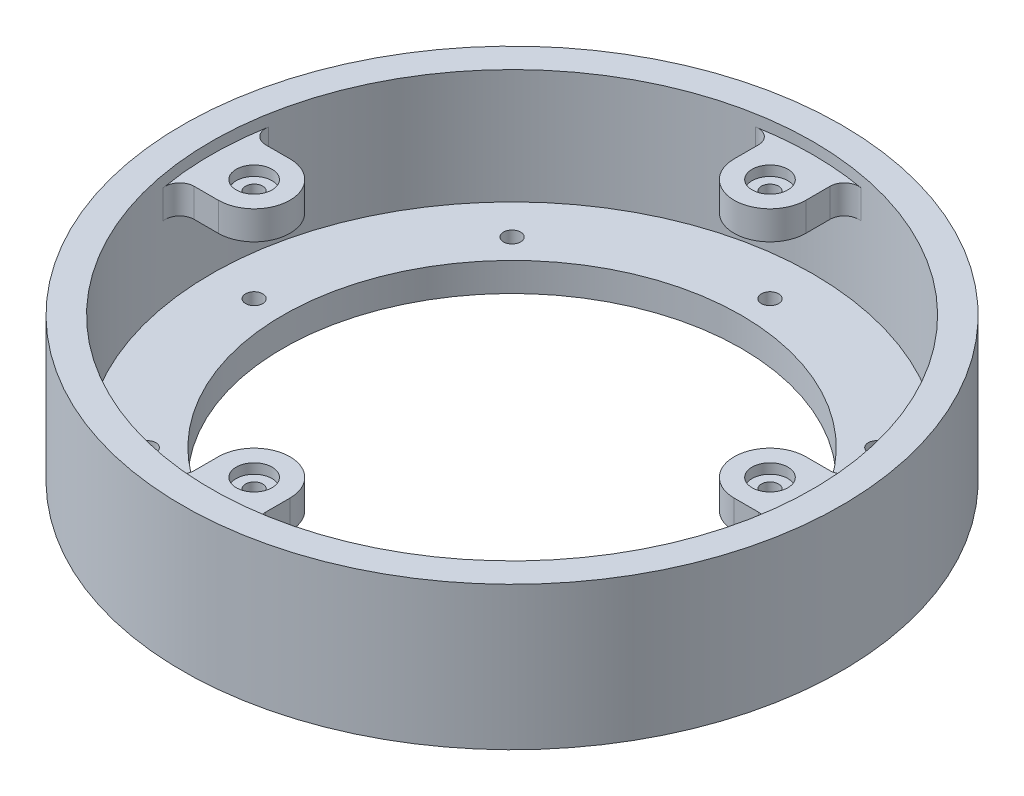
ISO-10303-21;
HEADER;
FILE_DESCRIPTION(('STEP AP214'),'2;1');
FILE_NAME('part.step','',(''),(''),'','','');
FILE_SCHEMA(('AUTOMOTIVE_DESIGN { 1 0 10303 214 1 1 1 1 }'));
ENDSEC;
DATA;
#1=APPLICATION_CONTEXT('core data for automotive mechanical design processes');
#2=APPLICATION_PROTOCOL_DEFINITION('international standard','automotive_design',2000,#1);
#3=PRODUCT_CONTEXT('',#1,'mechanical');
#4=PRODUCT('Part','Part','',(#3));
#5=PRODUCT_RELATED_PRODUCT_CATEGORY('part','',(#4));
#6=PRODUCT_DEFINITION_FORMATION('','',#4);
#7=PRODUCT_DEFINITION_CONTEXT('part definition',#1,'design');
#8=PRODUCT_DEFINITION('design','',#6,#7);
#9=PRODUCT_DEFINITION_SHAPE('','',#8);
#10=(LENGTH_UNIT() NAMED_UNIT(*) SI_UNIT(.MILLI.,.METRE.));
#11=(NAMED_UNIT(*) PLANE_ANGLE_UNIT() SI_UNIT($,.RADIAN.));
#12=(NAMED_UNIT(*) SI_UNIT($,.STERADIAN.) SOLID_ANGLE_UNIT());
#13=UNCERTAINTY_MEASURE_WITH_UNIT(LENGTH_MEASURE(1.E-05),#10,'distance_accuracy_value','');
#14=(GEOMETRIC_REPRESENTATION_CONTEXT(3) GLOBAL_UNCERTAINTY_ASSIGNED_CONTEXT((#13)) GLOBAL_UNIT_ASSIGNED_CONTEXT((#10,
#11,#12)) REPRESENTATION_CONTEXT('',''));
#15=CARTESIAN_POINT('',(0.,0.,0.));
#16=DIRECTION('',(0.,0.,1.));
#17=DIRECTION('',(1.,0.,0.));
#18=AXIS2_PLACEMENT_3D('',#15,#16,#17);
#19=CARTESIAN_POINT('',(-40.4111525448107,29.21,-40.4111525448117));
#20=DIRECTION('',(0.,1.,0.));
#21=DIRECTION('',(0.707106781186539,0.,0.707106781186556));
#22=AXIS2_PLACEMENT_3D('',#19,#20,#21);
#23=CYLINDRICAL_SURFACE('',#22,1.89865);
#24=CARTESIAN_POINT('',(-40.4111525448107,0.,-40.4111525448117));
#25=DIRECTION('',(0.,1.,0.));
#26=DIRECTION('',(0.707106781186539,0.,0.707106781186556));
#27=AXIS2_PLACEMENT_3D('',#24,#25,#26);
#28=CIRCLE('',#27,1.89865);
#29=CARTESIAN_POINT('',(-39.0686042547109,0.,-39.0686042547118));
#30=VERTEX_POINT('',#29);
#31=EDGE_CURVE('E37',#30,#30,#28,.F.);
#32=ORIENTED_EDGE('',*,*,#31,.T.);
#33=EDGE_LOOP('',(#32));
#34=FACE_BOUND('',#33,.T.);
#35=CARTESIAN_POINT('',(-40.4111525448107,6.35,-40.4111525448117));
#36=DIRECTION('',(0.,1.,0.));
#37=DIRECTION('',(0.707106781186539,0.,0.707106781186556));
#38=AXIS2_PLACEMENT_3D('',#35,#36,#37);
#39=CIRCLE('',#38,1.89865);
#40=CARTESIAN_POINT('',(-39.0686042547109,6.35,-39.0686042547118));
#41=VERTEX_POINT('',#40);
#42=EDGE_CURVE('E11',#41,#41,#39,.F.);
#43=ORIENTED_EDGE('',*,*,#42,.F.);
#44=EDGE_LOOP('',(#43));
#45=FACE_BOUND('',#44,.T.);
#46=ADVANCED_FACE('F30',(#34,#45),#23,.F.);
#47=CARTESIAN_POINT('',(-57.15,29.21,-5.98614822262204E-13));
#48=DIRECTION('',(0.,1.,0.));
#49=DIRECTION('',(1.,0.,0.));
#50=AXIS2_PLACEMENT_3D('',#47,#48,#49);
#51=CYLINDRICAL_SURFACE('',#50,1.89865);
#52=CARTESIAN_POINT('',(-57.15,0.,-5.98614822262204E-13));
#53=DIRECTION('',(0.,1.,0.));
#54=DIRECTION('',(1.,0.,0.));
#55=AXIS2_PLACEMENT_3D('',#52,#53,#54);
#56=CIRCLE('',#55,1.89865);
#57=CARTESIAN_POINT('',(-55.25135,0.,-5.78727507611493E-13));
#58=VERTEX_POINT('',#57);
#59=EDGE_CURVE('E976',#58,#58,#56,.F.);
#60=ORIENTED_EDGE('',*,*,#59,.T.);
#61=EDGE_LOOP('',(#60));
#62=FACE_BOUND('',#61,.T.);
#63=CARTESIAN_POINT('',(-57.15,6.35,-5.98614822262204E-13));
#64=DIRECTION('',(0.,1.,0.));
#65=DIRECTION('',(1.,0.,0.));
#66=AXIS2_PLACEMENT_3D('',#63,#64,#65);
#67=CIRCLE('',#66,1.89865);
#68=CARTESIAN_POINT('',(-55.25135,6.35,-5.78727507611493E-13));
#69=VERTEX_POINT('',#68);
#70=EDGE_CURVE('E979',#69,#69,#67,.F.);
#71=ORIENTED_EDGE('',*,*,#70,.F.);
#72=EDGE_LOOP('',(#71));
#73=FACE_BOUND('',#72,.T.);
#74=ADVANCED_FACE('F1056',(#62,#73),#51,.F.);
#75=CARTESIAN_POINT('',(-40.4111525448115,29.21,40.4111525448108));
#76=DIRECTION('',(0.,1.,0.));
#77=DIRECTION('',(0.707106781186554,0.,-0.707106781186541));
#78=AXIS2_PLACEMENT_3D('',#75,#76,#77);
#79=CYLINDRICAL_SURFACE('',#78,1.89865);
#80=CARTESIAN_POINT('',(-40.4111525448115,0.,40.4111525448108));
#81=DIRECTION('',(0.,1.,0.));
#82=DIRECTION('',(0.707106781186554,0.,-0.707106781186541));
#83=AXIS2_PLACEMENT_3D('',#80,#81,#82);
#84=CIRCLE('',#83,1.89865);
#85=CARTESIAN_POINT('',(-39.0686042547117,0.,39.068604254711));
#86=VERTEX_POINT('',#85);
#87=EDGE_CURVE('E970',#86,#86,#84,.F.);
#88=CARTESIAN_POINT('',(-40.4111525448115,6.35,40.4111525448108));
#89=DIRECTION('',(0.,1.,0.));
#90=DIRECTION('',(0.707106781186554,0.,-0.707106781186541));
#91=AXIS2_PLACEMENT_3D('',#88,#89,#90);
#92=CIRCLE('',#91,1.89865);
#93=CARTESIAN_POINT('',(-39.0686042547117,6.35,39.068604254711));
#94=VERTEX_POINT('',#93);
#95=EDGE_CURVE('E973',#94,#94,#92,.F.);
#96=CARTESIAN_POINT('',(-39.0686042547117,0.,39.068604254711));
#97=CARTESIAN_POINT('',(-39.0686042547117,0.0661458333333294,39.068604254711));
#98=CARTESIAN_POINT('',(-39.0686042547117,0.132291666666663,39.068604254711));
#99=CARTESIAN_POINT('',(-39.0686042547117,0.26458333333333,39.068604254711));
#100=CARTESIAN_POINT('',(-39.0686042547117,0.330729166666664,39.068604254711));
#101=CARTESIAN_POINT('',(-39.0686042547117,0.463020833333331,39.068604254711));
#102=CARTESIAN_POINT('',(-39.0686042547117,0.529166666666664,39.068604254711));
#103=CARTESIAN_POINT('',(-39.0686042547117,0.66145833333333,39.068604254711));
#104=CARTESIAN_POINT('',(-39.0686042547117,0.727604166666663,39.068604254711));
#105=CARTESIAN_POINT('',(-39.0686042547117,0.85989583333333,39.068604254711));
#106=CARTESIAN_POINT('',(-39.0686042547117,0.926041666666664,39.068604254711));
#107=CARTESIAN_POINT('',(-39.0686042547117,1.05833333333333,39.068604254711));
#108=CARTESIAN_POINT('',(-39.0686042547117,1.12447916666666,39.068604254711));
#109=CARTESIAN_POINT('',(-39.0686042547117,1.25677083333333,39.068604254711));
#110=CARTESIAN_POINT('',(-39.0686042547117,1.32291666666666,39.068604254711));
#111=CARTESIAN_POINT('',(-39.0686042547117,1.45520833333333,39.068604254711));
#112=CARTESIAN_POINT('',(-39.0686042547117,1.52135416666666,39.068604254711));
#113=CARTESIAN_POINT('',(-39.0686042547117,1.65364583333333,39.068604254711));
#114=CARTESIAN_POINT('',(-39.0686042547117,1.71979166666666,39.068604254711));
#115=CARTESIAN_POINT('',(-39.0686042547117,1.85208333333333,39.068604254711));
#116=CARTESIAN_POINT('',(-39.0686042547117,1.91822916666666,39.068604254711));
#117=CARTESIAN_POINT('',(-39.0686042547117,2.05052083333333,39.068604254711));
#118=CARTESIAN_POINT('',(-39.0686042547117,2.11666666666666,39.068604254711));
#119=CARTESIAN_POINT('',(-39.0686042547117,2.24895833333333,39.068604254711));
#120=CARTESIAN_POINT('',(-39.0686042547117,2.31510416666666,39.068604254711));
#121=CARTESIAN_POINT('',(-39.0686042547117,2.44739583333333,39.068604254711));
#122=CARTESIAN_POINT('',(-39.0686042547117,2.51354166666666,39.068604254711));
#123=CARTESIAN_POINT('',(-39.0686042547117,2.64583333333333,39.068604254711));
#124=CARTESIAN_POINT('',(-39.0686042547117,2.71197916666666,39.068604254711));
#125=CARTESIAN_POINT('',(-39.0686042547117,2.84427083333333,39.068604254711));
#126=CARTESIAN_POINT('',(-39.0686042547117,2.91041666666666,39.068604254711));
#127=CARTESIAN_POINT('',(-39.0686042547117,3.04270833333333,39.068604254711));
#128=CARTESIAN_POINT('',(-39.0686042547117,3.10885416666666,39.068604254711));
#129=CARTESIAN_POINT('',(-39.0686042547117,3.24114583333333,39.068604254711));
#130=CARTESIAN_POINT('',(-39.0686042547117,3.30729166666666,39.068604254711));
#131=CARTESIAN_POINT('',(-39.0686042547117,3.43958333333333,39.068604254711));
#132=CARTESIAN_POINT('',(-39.0686042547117,3.50572916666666,39.068604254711));
#133=CARTESIAN_POINT('',(-39.0686042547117,3.63802083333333,39.068604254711));
#134=CARTESIAN_POINT('',(-39.0686042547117,3.70416666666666,39.068604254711));
#135=CARTESIAN_POINT('',(-39.0686042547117,3.83645833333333,39.068604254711));
#136=CARTESIAN_POINT('',(-39.0686042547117,3.90260416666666,39.068604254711));
#137=CARTESIAN_POINT('',(-39.0686042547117,4.03489583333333,39.068604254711));
#138=CARTESIAN_POINT('',(-39.0686042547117,4.10104166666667,39.068604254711));
#139=CARTESIAN_POINT('',(-39.0686042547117,4.23333333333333,39.068604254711));
#140=CARTESIAN_POINT('',(-39.0686042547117,4.29947916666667,39.068604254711));
#141=CARTESIAN_POINT('',(-39.0686042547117,4.43177083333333,39.068604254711));
#142=CARTESIAN_POINT('',(-39.0686042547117,4.49791666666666,39.068604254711));
#143=CARTESIAN_POINT('',(-39.0686042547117,4.63020833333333,39.068604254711));
#144=CARTESIAN_POINT('',(-39.0686042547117,4.69635416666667,39.068604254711));
#145=CARTESIAN_POINT('',(-39.0686042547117,4.82864583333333,39.068604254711));
#146=CARTESIAN_POINT('',(-39.0686042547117,4.89479166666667,39.068604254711));
#147=CARTESIAN_POINT('',(-39.0686042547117,5.02708333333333,39.068604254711));
#148=CARTESIAN_POINT('',(-39.0686042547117,5.09322916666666,39.068604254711));
#149=CARTESIAN_POINT('',(-39.0686042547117,5.22552083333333,39.068604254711));
#150=CARTESIAN_POINT('',(-39.0686042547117,5.29166666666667,39.068604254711));
#151=CARTESIAN_POINT('',(-39.0686042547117,5.42395833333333,39.068604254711));
#152=CARTESIAN_POINT('',(-39.0686042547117,5.49010416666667,39.068604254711));
#153=CARTESIAN_POINT('',(-39.0686042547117,5.62239583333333,39.068604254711));
#154=CARTESIAN_POINT('',(-39.0686042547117,5.68854166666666,39.068604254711));
#155=CARTESIAN_POINT('',(-39.0686042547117,5.82083333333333,39.068604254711));
#156=CARTESIAN_POINT('',(-39.0686042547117,5.88697916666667,39.068604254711));
#157=CARTESIAN_POINT('',(-39.0686042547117,6.01927083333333,39.068604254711));
#158=CARTESIAN_POINT('',(-39.0686042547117,6.08541666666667,39.068604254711));
#159=CARTESIAN_POINT('',(-39.0686042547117,6.21770833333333,39.068604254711));
#160=CARTESIAN_POINT('',(-39.0686042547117,6.28385416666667,39.068604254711));
#161=CARTESIAN_POINT('',(-39.0686042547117,6.35,39.068604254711));
#162=B_SPLINE_CURVE_WITH_KNOTS('',3,(#96,#97,#98,#99,#100,#101,#102,#103,#104,#105,#106,#107,
#108,#109,#110,#111,#112,#113,#114,#115,#116,#117,#118,#119,#120,#121,#122,#123,#124,#125,#126,
#127,#128,#129,#130,#131,#132,#133,#134,#135,#136,#137,#138,#139,#140,#141,#142,#143,#144,#145,
#146,#147,#148,#149,#150,#151,#152,#153,#154,#155,#156,#157,#158,#159,#160,#161),.UNSPECIFIED.,
.F.,.F.,(4,2,2,2,2,2,2,2,2,2,2,2,2,2,2,2,2,2,2,2,2,2,2,2,2,2,2,2,2,2,2,2,4),(0.,
0.198437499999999,0.396875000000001,0.5953125,0.793749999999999,0.992187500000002,1.190625,
1.3890625,1.5875,1.7859375,1.984375,2.1828125,2.38125,2.5796875,2.778125,2.9765625,3.175,
3.3734375,3.571875,3.7703125,3.96875,4.1671875,4.365625,4.5640625,4.7625,4.9609375,5.159375,
5.3578125,5.55625,5.7546875,5.953125,6.1515625,6.35),.UNSPECIFIED.);
#163=EDGE_CURVE('BSEAM1060',#86,#94,#162,.T.);
#164=ORIENTED_EDGE('',*,*,#87,.T.);
#165=ORIENTED_EDGE('',*,*,#95,.F.);
#166=ORIENTED_EDGE('',*,*,#163,.T.);
#167=ORIENTED_EDGE('',*,*,#163,.F.);
#168=EDGE_LOOP('',(#164,#166,#165,#167));
#169=FACE_BOUND('',#168,.T.);
#170=ADVANCED_FACE('F1060',(#169),#79,.F.);
#171=CARTESIAN_POINT('',(-3.99076548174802E-13,29.21,57.15));
#172=DIRECTION('',(0.,1.,0.));
#173=DIRECTION('',(0.,0.,-1.));
#174=AXIS2_PLACEMENT_3D('',#171,#172,#173);
#175=CYLINDRICAL_SURFACE('',#174,1.89865);
#176=CARTESIAN_POINT('',(-3.99076548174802E-13,0.,57.15));
#177=DIRECTION('',(0.,1.,0.));
#178=DIRECTION('',(0.,0.,-1.));
#179=AXIS2_PLACEMENT_3D('',#176,#177,#178);
#180=CIRCLE('',#179,1.89865);
#181=CARTESIAN_POINT('',(-3.85818338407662E-13,0.,55.25135));
#182=VERTEX_POINT('',#181);
#183=EDGE_CURVE('E964',#182,#182,#180,.F.);
#184=ORIENTED_EDGE('',*,*,#183,.T.);
#185=EDGE_LOOP('',(#184));
#186=FACE_BOUND('',#185,.T.);
#187=CARTESIAN_POINT('',(-3.99076548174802E-13,6.35,57.15));
#188=DIRECTION('',(0.,1.,0.));
#189=DIRECTION('',(0.,0.,-1.));
#190=AXIS2_PLACEMENT_3D('',#187,#188,#189);
#191=CIRCLE('',#190,1.89865);
#192=CARTESIAN_POINT('',(-3.85818338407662E-13,6.35,55.25135));
#193=VERTEX_POINT('',#192);
#194=EDGE_CURVE('E967',#193,#193,#191,.F.);
#195=ORIENTED_EDGE('',*,*,#194,.F.);
#196=EDGE_LOOP('',(#195));
#197=FACE_BOUND('',#196,.T.);
#198=ADVANCED_FACE('F1065',(#186,#197),#175,.F.);
#199=CARTESIAN_POINT('',(40.411152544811,29.21,40.4111525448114));
#200=DIRECTION('',(0.,1.,0.));
#201=DIRECTION('',(-0.707106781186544,0.,-0.707106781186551));
#202=AXIS2_PLACEMENT_3D('',#199,#200,#201);
#203=CYLINDRICAL_SURFACE('',#202,1.89865);
#204=CARTESIAN_POINT('',(40.411152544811,0.,40.4111525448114));
#205=DIRECTION('',(0.,1.,0.));
#206=DIRECTION('',(-0.707106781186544,0.,-0.707106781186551));
#207=AXIS2_PLACEMENT_3D('',#204,#205,#206);
#208=CIRCLE('',#207,1.89865);
#209=CARTESIAN_POINT('',(39.0686042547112,0.,39.0686042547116));
#210=VERTEX_POINT('',#209);
#211=EDGE_CURVE('E958',#210,#210,#208,.F.);
#212=ORIENTED_EDGE('',*,*,#211,.T.);
#213=EDGE_LOOP('',(#212));
#214=FACE_BOUND('',#213,.T.);
#215=CARTESIAN_POINT('',(40.411152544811,6.35,40.4111525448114));
#216=DIRECTION('',(0.,1.,0.));
#217=DIRECTION('',(-0.707106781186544,0.,-0.707106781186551));
#218=AXIS2_PLACEMENT_3D('',#215,#216,#217);
#219=CIRCLE('',#218,1.89865);
#220=CARTESIAN_POINT('',(39.0686042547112,6.35,39.0686042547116));
#221=VERTEX_POINT('',#220);
#222=EDGE_CURVE('E961',#221,#221,#219,.F.);
#223=ORIENTED_EDGE('',*,*,#222,.F.);
#224=EDGE_LOOP('',(#223));
#225=FACE_BOUND('',#224,.T.);
#226=ADVANCED_FACE('F1072',(#214,#225),#203,.F.);
#227=CARTESIAN_POINT('',(57.15,29.21,1.99538274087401E-13));
#228=DIRECTION('',(0.,1.,0.));
#229=DIRECTION('',(-1.,0.,0.));
#230=AXIS2_PLACEMENT_3D('',#227,#228,#229);
#231=CYLINDRICAL_SURFACE('',#230,1.89865);
#232=CARTESIAN_POINT('',(57.15,0.,1.99538274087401E-13));
#233=DIRECTION('',(0.,1.,0.));
#234=DIRECTION('',(-1.,0.,0.));
#235=AXIS2_PLACEMENT_3D('',#232,#233,#234);
#236=CIRCLE('',#235,1.89865);
#237=CARTESIAN_POINT('',(55.25135,0.,1.92909169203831E-13));
#238=VERTEX_POINT('',#237);
#239=EDGE_CURVE('E952',#238,#238,#236,.F.);
#240=ORIENTED_EDGE('',*,*,#239,.T.);
#241=EDGE_LOOP('',(#240));
#242=FACE_BOUND('',#241,.T.);
#243=CARTESIAN_POINT('',(57.15,6.35,1.99538274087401E-13));
#244=DIRECTION('',(0.,1.,0.));
#245=DIRECTION('',(-1.,0.,0.));
#246=AXIS2_PLACEMENT_3D('',#243,#244,#245);
#247=CIRCLE('',#246,1.89865);
#248=CARTESIAN_POINT('',(55.25135,6.35,1.92909169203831E-13));
#249=VERTEX_POINT('',#248);
#250=EDGE_CURVE('E955',#249,#249,#247,.F.);
#251=ORIENTED_EDGE('',*,*,#250,.F.);
#252=EDGE_LOOP('',(#251));
#253=FACE_BOUND('',#252,.T.);
#254=ADVANCED_FACE('F1075',(#242,#253),#231,.F.);
#255=CARTESIAN_POINT('',(40.4111525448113,29.21,-40.4111525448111));
#256=DIRECTION('',(0.,1.,0.));
#257=DIRECTION('',(-0.707106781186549,0.,0.707106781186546));
#258=AXIS2_PLACEMENT_3D('',#255,#256,#257);
#259=CYLINDRICAL_SURFACE('',#258,1.89865);
#260=CARTESIAN_POINT('',(40.4111525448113,0.,-40.4111525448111));
#261=DIRECTION('',(0.,1.,0.));
#262=DIRECTION('',(-0.707106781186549,0.,0.707106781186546));
#263=AXIS2_PLACEMENT_3D('',#260,#261,#262);
#264=CIRCLE('',#263,1.89865);
#265=CARTESIAN_POINT('',(39.0686042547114,0.,-39.0686042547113));
#266=VERTEX_POINT('',#265);
#267=EDGE_CURVE('E946',#266,#266,#264,.F.);
#268=ORIENTED_EDGE('',*,*,#267,.T.);
#269=EDGE_LOOP('',(#268));
#270=FACE_BOUND('',#269,.T.);
#271=CARTESIAN_POINT('',(40.4111525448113,6.35,-40.4111525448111));
#272=DIRECTION('',(0.,1.,0.));
#273=DIRECTION('',(-0.707106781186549,0.,0.707106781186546));
#274=AXIS2_PLACEMENT_3D('',#271,#272,#273);
#275=CIRCLE('',#274,1.89865);
#276=CARTESIAN_POINT('',(39.0686042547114,6.35,-39.0686042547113));
#277=VERTEX_POINT('',#276);
#278=EDGE_CURVE('E949',#277,#277,#275,.F.);
#279=ORIENTED_EDGE('',*,*,#278,.F.);
#280=EDGE_LOOP('',(#279));
#281=FACE_BOUND('',#280,.T.);
#282=ADVANCED_FACE('F856',(#270,#281),#259,.F.);
#283=CARTESIAN_POINT('',(57.15,29.21,-5.98614822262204E-13));
#284=DIRECTION('',(0.,1.,0.));
#285=DIRECTION('',(-1.,0.,0.));
#286=AXIS2_PLACEMENT_3D('',#283,#284,#285);
#287=CYLINDRICAL_SURFACE('',#286,1.89865);
#288=CARTESIAN_POINT('',(57.15,22.86,-5.98614822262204E-13));
#289=DIRECTION('',(0.,-1.,0.));
#290=DIRECTION('',(1.,0.,0.));
#291=AXIS2_PLACEMENT_3D('',#288,#289,#290);
#292=CIRCLE('',#291,1.89864999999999);
#293=CARTESIAN_POINT('',(59.04865,22.86,-6.18269627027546E-13));
#294=VERTEX_POINT('',#293);
#295=CARTESIAN_POINT('',(55.25135,22.86,-5.7882051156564E-13));
#296=VERTEX_POINT('',#295);
#297=EDGE_CURVE('E834',#294,#296,#292,.T.);
#298=ORIENTED_EDGE('',*,*,#297,.T.);
#299=CARTESIAN_POINT('',(57.15,22.86,-5.98614822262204E-13));
#300=DIRECTION('',(0.,-1.,0.));
#301=DIRECTION('',(-1.,0.,0.));
#302=AXIS2_PLACEMENT_3D('',#299,#300,#301);
#303=CIRCLE('',#302,1.89864999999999);
#304=EDGE_CURVE('E43',#296,#294,#303,.T.);
#305=ORIENTED_EDGE('',*,*,#304,.T.);
#306=EDGE_LOOP('',(#298,#305));
#307=FACE_BOUND('',#306,.T.);
#308=CARTESIAN_POINT('',(55.25135,27.0002,-5.78747119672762E-13));
#309=CARTESIAN_POINT('',(55.2514513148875,27.0002,-0.362678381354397));
#310=CARTESIAN_POINT('',(55.3846574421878,27.0002,-0.698883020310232));
#311=CARTESIAN_POINT('',(55.529694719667,27.0002,-1.06494880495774));
#312=CARTESIAN_POINT('',(55.8074517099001,27.0002,-1.34254829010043));
#313=CARTESIAN_POINT('',(56.0859541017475,27.0002,-1.62089275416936));
#314=CARTESIAN_POINT('',(56.4511169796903,27.0002,-1.76534255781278));
#315=CARTESIAN_POINT('',(56.7883678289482,27.0002,-1.89875102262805));
#316=CARTESIAN_POINT('',(57.15,27.0002,-1.8986500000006));
#317=CARTESIAN_POINT('',(57.512678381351,27.0002,-1.89854868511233));
#318=CARTESIAN_POINT('',(57.8488830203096,27.0002,-1.76534255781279));
#319=CARTESIAN_POINT('',(58.2149488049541,27.0002,-1.62030528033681));
#320=CARTESIAN_POINT('',(58.4925482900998,27.0002,-1.34254829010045));
#321=CARTESIAN_POINT('',(58.7708927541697,27.0002,-1.06404589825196));
#322=CARTESIAN_POINT('',(58.9153425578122,27.0002,-0.698883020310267));
#323=CARTESIAN_POINT('',(59.0485488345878,27.0002,-0.362143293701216));
#324=CARTESIAN_POINT('',(59.04865,27.0002,-6.18428919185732E-13));
#325=B_SPLINE_CURVE_WITH_KNOTS('',2,(#308,#309,#310,#311,#312,#313,#314,#315,#316,#317,#318,
#319,#320,#321,#322,#323,#324),.UNSPECIFIED.,.F.,.F.,(3,2,2,2,2,2,2,2,3),(0.,0.125,0.25,0.375,
0.5,0.625,0.75,0.875,1.),.UNSPECIFIED.);
#326=CARTESIAN_POINT('',(55.25135,27.0002,-5.7882051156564E-13));
#327=VERTEX_POINT('',#326);
#328=CARTESIAN_POINT('',(59.04865,27.0002,-6.18275894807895E-13));
#329=VERTEX_POINT('',#328);
#330=EDGE_CURVE('E718',#327,#329,#325,.T.);
#331=ORIENTED_EDGE('',*,*,#330,.F.);
#332=CARTESIAN_POINT('',(59.04865,27.0002,-6.18428919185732E-13));
#333=CARTESIAN_POINT('',(59.0485486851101,27.0002,0.362678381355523));
#334=CARTESIAN_POINT('',(58.9153425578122,27.0002,0.698883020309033));
#335=CARTESIAN_POINT('',(58.7703052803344,27.0002,1.06494880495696));
#336=CARTESIAN_POINT('',(58.4925482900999,27.0002,1.34254829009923));
#337=CARTESIAN_POINT('',(58.2140458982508,27.0002,1.62089275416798));
#338=CARTESIAN_POINT('',(57.8488830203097,27.0002,1.76534255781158));
#339=CARTESIAN_POINT('',(57.5116321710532,27.0002,1.89875102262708));
#340=CARTESIAN_POINT('',(57.15,27.0002,1.8986499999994));
#341=CARTESIAN_POINT('',(56.7873216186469,27.0002,1.89854868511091));
#342=CARTESIAN_POINT('',(56.4511169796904,27.0002,1.76534255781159));
#343=CARTESIAN_POINT('',(56.0850511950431,27.0002,1.62030528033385));
#344=CARTESIAN_POINT('',(55.8074517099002,27.0002,1.34254829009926));
#345=CARTESIAN_POINT('',(55.5291072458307,27.0002,1.06404589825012));
#346=CARTESIAN_POINT('',(55.3846574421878,27.0002,0.69888302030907));
#347=CARTESIAN_POINT('',(55.2514511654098,27.0002,0.362143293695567));
#348=CARTESIAN_POINT('',(55.25135,27.0002,-5.78747119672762E-13));
#349=B_SPLINE_CURVE_WITH_KNOTS('',2,(#332,#333,#334,#335,#336,#337,#338,#339,#340,#341,#342,
#343,#344,#345,#346,#347,#348),.UNSPECIFIED.,.F.,.F.,(3,2,2,2,2,2,2,2,3),(0.,0.125,0.25,0.375,
0.5,0.625,0.75,0.875,1.),.UNSPECIFIED.);
#350=EDGE_CURVE('E729',#329,#327,#349,.T.);
#351=ORIENTED_EDGE('',*,*,#350,.F.);
#352=EDGE_LOOP('',(#331,#351));
#353=FACE_BOUND('',#352,.T.);
#354=ADVANCED_FACE('F847',(#307,#353),#287,.F.);
#355=CARTESIAN_POINT('',(0.,22.86,0.));
#356=DIRECTION('',(0.,1.,0.));
#357=DIRECTION('',(-1.,0.,0.));
#358=AXIS2_PLACEMENT_3D('',#355,#356,#357);
#359=PLANE('',#358);
#360=CARTESIAN_POINT('',(62.5200955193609,22.86,11.1124999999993));
#361=DIRECTION('',(0.,-1.,0.));
#362=DIRECTION('',(0.,0.,-1.));
#363=AXIS2_PLACEMENT_3D('',#360,#361,#362);
#364=CIRCLE('',#363,3.175);
#365=CARTESIAN_POINT('',(62.5200955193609,22.86,7.93749999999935));
#366=VERTEX_POINT('',#365);
#367=CARTESIAN_POINT('',(65.7181098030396,22.86,11.1163929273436));
#368=VERTEX_POINT('',#367);
#369=EDGE_CURVE('E638',#366,#368,#364,.T.);
#370=ORIENTED_EDGE('',*,*,#369,.F.);
#371=DIRECTION('',(-1.,0.,0.));
#372=VECTOR('',#371,1.);
#373=CARTESIAN_POINT('',(0.,22.86,7.9375));
#374=LINE('',#373,#372);
#375=CARTESIAN_POINT('',(57.1500000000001,22.86,7.9374999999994));
#376=VERTEX_POINT('',#375);
#377=EDGE_CURVE('E902',#376,#366,#374,.F.);
#378=ORIENTED_EDGE('',*,*,#377,.F.);
#379=CARTESIAN_POINT('',(57.15,22.86,-5.98614822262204E-13));
#380=DIRECTION('',(0.,1.,0.));
#381=DIRECTION('',(-1.,0.,0.));
#382=AXIS2_PLACEMENT_3D('',#379,#380,#381);
#383=CIRCLE('',#382,7.9375);
#384=CARTESIAN_POINT('',(49.2125,22.86,-5.15862687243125E-13));
#385=VERTEX_POINT('',#384);
#386=EDGE_CURVE('E795',#385,#376,#383,.T.);
#387=ORIENTED_EDGE('',*,*,#386,.F.);
#388=CARTESIAN_POINT('',(57.15,22.86,-5.98614822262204E-13));
#389=DIRECTION('',(0.,1.,0.));
#390=DIRECTION('',(0.,0.,-1.));
#391=AXIS2_PLACEMENT_3D('',#388,#389,#390);
#392=CIRCLE('',#391,7.9375);
#393=CARTESIAN_POINT('',(57.1499999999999,22.86,-7.9375000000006));
#394=VERTEX_POINT('',#393);
#395=EDGE_CURVE('E604',#394,#385,#392,.T.);
#396=ORIENTED_EDGE('',*,*,#395,.F.);
#397=DIRECTION('',(-1.,0.,0.));
#398=VECTOR('',#397,1.);
#399=CARTESIAN_POINT('',(0.,22.86,-7.9375));
#400=LINE('',#399,#398);
#401=CARTESIAN_POINT('',(62.5200955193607,22.86,-7.93750000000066));
#402=VERTEX_POINT('',#401);
#403=EDGE_CURVE('E931',#402,#394,#400,.T.);
#404=ORIENTED_EDGE('',*,*,#403,.F.);
#405=CARTESIAN_POINT('',(62.5200955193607,22.86,-11.1125000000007));
#406=DIRECTION('',(0.,-1.,0.));
#407=DIRECTION('',(1.,0.,0.));
#408=AXIS2_PLACEMENT_3D('',#405,#406,#407);
#409=CIRCLE('',#408,3.175);
#410=CARTESIAN_POINT('',(65.7181098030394,22.86,-11.116392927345));
#411=VERTEX_POINT('',#410);
#412=EDGE_CURVE('E773',#411,#402,#409,.T.);
#413=ORIENTED_EDGE('',*,*,#412,.F.);
#414=CARTESIAN_POINT('',(0.,22.86,0.));
#415=DIRECTION('',(0.,-1.,0.));
#416=DIRECTION('',(1.,0.,0.));
#417=AXIS2_PLACEMENT_3D('',#414,#415,#416);
#418=CIRCLE('',#417,66.675);
#419=EDGE_CURVE('E942',#411,#368,#418,.T.);
#420=ORIENTED_EDGE('',*,*,#419,.T.);
#421=EDGE_LOOP('',(#370,#378,#387,#396,#404,#413,#420));
#422=FACE_BOUND('',#421,.T.);
#423=ORIENTED_EDGE('',*,*,#304,.F.);
#424=ORIENTED_EDGE('',*,*,#297,.F.);
#425=EDGE_LOOP('',(#423,#424));
#426=FACE_BOUND('',#425,.T.);
#427=ADVANCED_FACE('F756',(#422,#426),#359,.F.);
#428=CARTESIAN_POINT('',(62.5200955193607,31.75,-11.1125000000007));
#429=DIRECTION('',(0.,-1.,0.));
#430=DIRECTION('',(1.,0.,0.));
#431=AXIS2_PLACEMENT_3D('',#428,#429,#430);
#432=CYLINDRICAL_SURFACE('',#431,3.175);
#433=CARTESIAN_POINT('',(0.,29.21,0.));
#434=DIRECTION('',(0.,-1.,0.));
#435=DIRECTION('',(0.984568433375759,0.,-0.17500000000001));
#436=AXIS2_PLACEMENT_3D('',#433,#434,#435);
#437=CIRCLE('',#436,66.675);
#438=CARTESIAN_POINT('',(65.6461002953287,29.21,-11.6681250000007));
#439=VERTEX_POINT('',#438);
#440=CARTESIAN_POINT('',(65.7181098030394,29.21,-11.116392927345));
#441=VERTEX_POINT('',#440);
#442=EDGE_CURVE('E591',#439,#441,#437,.T.);
#443=ORIENTED_EDGE('',*,*,#442,.F.);
#444=DIRECTION('',(0.,-1.,0.));
#445=VECTOR('',#444,1.);
#446=CARTESIAN_POINT('',(65.6461002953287,31.75,-11.6681250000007));
#447=LINE('',#446,#445);
#448=CARTESIAN_POINT('',(65.6461002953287,22.86,-11.6681250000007));
#449=VERTEX_POINT('',#448);
#450=EDGE_CURVE('E937',#439,#449,#447,.T.);
#451=ORIENTED_EDGE('',*,*,#450,.T.);
#452=CARTESIAN_POINT('',(0.,22.86,0.));
#453=DIRECTION('',(0.,1.,0.));
#454=DIRECTION('',(0.985993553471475,0.,-0.166783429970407));
#455=AXIS2_PLACEMENT_3D('',#452,#453,#454);
#456=CIRCLE('',#455,66.675);
#457=EDGE_CURVE('E939',#411,#449,#456,.T.);
#458=ORIENTED_EDGE('',*,*,#457,.F.);
#459=ORIENTED_EDGE('',*,*,#412,.T.);
#460=DIRECTION('',(0.,1.,0.));
#461=VECTOR('',#460,1.);
#462=CARTESIAN_POINT('',(62.5200955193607,22.86,-7.93750000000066));
#463=LINE('',#462,#461);
#464=CARTESIAN_POINT('',(62.5200955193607,29.21,-7.93750000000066));
#465=VERTEX_POINT('',#464);
#466=EDGE_CURVE('E929',#402,#465,#463,.T.);
#467=ORIENTED_EDGE('',*,*,#466,.T.);
#468=CARTESIAN_POINT('',(62.5200955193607,29.21,-11.1125000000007));
#469=DIRECTION('',(0.,-1.,0.));
#470=DIRECTION('',(1.,0.,0.));
#471=AXIS2_PLACEMENT_3D('',#468,#469,#470);
#472=CIRCLE('',#471,3.175);
#473=EDGE_CURVE('E917',#441,#465,#472,.T.);
#474=ORIENTED_EDGE('',*,*,#473,.F.);
#475=EDGE_LOOP('',(#443,#451,#458,#459,#467,#474));
#476=FACE_BOUND('',#475,.T.);
#477=ADVANCED_FACE('F746',(#476),#432,.F.);
#478=CARTESIAN_POINT('',(57.1499999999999,22.86,-7.9375000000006));
#479=DIRECTION('',(0.,0.,1.));
#480=DIRECTION('',(1.,0.,0.));
#481=AXIS2_PLACEMENT_3D('',#478,#479,#480);
#482=PLANE('',#481);
#483=ORIENTED_EDGE('',*,*,#466,.F.);
#484=ORIENTED_EDGE('',*,*,#403,.T.);
#485=DIRECTION('',(0.,1.,0.));
#486=VECTOR('',#485,1.);
#487=CARTESIAN_POINT('',(57.1499999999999,22.86,-7.9375000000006));
#488=LINE('',#487,#486);
#489=CARTESIAN_POINT('',(57.1499999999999,29.21,-7.9375000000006));
#490=VERTEX_POINT('',#489);
#491=EDGE_CURVE('E891',#490,#394,#488,.F.);
#492=ORIENTED_EDGE('',*,*,#491,.F.);
#493=DIRECTION('',(-1.,0.,0.));
#494=VECTOR('',#493,1.);
#495=CARTESIAN_POINT('',(0.,29.21,-7.9375));
#496=LINE('',#495,#494);
#497=EDGE_CURVE('E921',#465,#490,#496,.T.);
#498=ORIENTED_EDGE('',*,*,#497,.F.);
#499=EDGE_LOOP('',(#483,#484,#492,#498));
#500=FACE_BOUND('',#499,.T.);
#501=ADVANCED_FACE('F755',(#500),#482,.F.);
#502=CARTESIAN_POINT('',(57.15,27.0002,1.8986499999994));
#503=DIRECTION('',(0.,-1.,0.));
#504=DIRECTION('',(1.,0.,0.));
#505=AXIS2_PLACEMENT_3D('',#502,#503,#504);
#506=PLANE('',#505);
#507=CARTESIAN_POINT('',(61.11875,27.0002,-6.39896122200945E-13));
#508=CARTESIAN_POINT('',(61.1186487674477,27.0002,-0.75753663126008));
#509=CARTESIAN_POINT('',(60.8400973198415,27.0002,-1.46087587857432));
#510=CARTESIAN_POINT('',(60.6917531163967,27.0002,-1.83544331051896));
#511=CARTESIAN_POINT('',(60.471825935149,27.0002,-2.17173870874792));
#512=CARTESIAN_POINT('',(60.2465956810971,27.0002,-2.5161431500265));
#513=CARTESIAN_POINT('',(59.9563300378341,27.0002,-2.80633003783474));
#514=CARTESIAN_POINT('',(59.6653068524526,27.0002,-3.09727426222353));
#515=CARTESIAN_POINT('',(59.3217387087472,27.0002,-3.32182593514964));
#516=CARTESIAN_POINT('',(58.984506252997,27.0002,-3.54223668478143));
#517=CARTESIAN_POINT('',(58.6108758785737,27.0002,-3.69009731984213));
#518=CARTESIAN_POINT('',(57.9064904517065,27.0002,-3.96885109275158));
#519=CARTESIAN_POINT('',(57.15,27.0002,-3.9687500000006));
#520=CARTESIAN_POINT('',(56.3924633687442,27.0002,-3.96864876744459));
#521=CARTESIAN_POINT('',(55.6891241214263,27.0002,-3.6900973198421));
#522=CARTESIAN_POINT('',(55.3145566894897,27.0002,-3.54175311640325));
#523=CARTESIAN_POINT('',(54.9782612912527,27.0002,-3.3218259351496));
#524=CARTESIAN_POINT('',(54.6338568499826,27.0002,-3.09659568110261));
#525=CARTESIAN_POINT('',(54.3436699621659,27.0002,-2.80633003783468));
#526=CARTESIAN_POINT('',(54.0527257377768,27.0002,-2.5153068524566));
#527=CARTESIAN_POINT('',(53.8281740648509,27.0002,-2.17173870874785));
#528=CARTESIAN_POINT('',(53.6077633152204,27.0002,-1.83450625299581));
#529=CARTESIAN_POINT('',(53.4599026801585,27.0002,-1.46087587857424));
#530=CARTESIAN_POINT('',(53.1813511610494,27.0002,-0.757001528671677));
#531=CARTESIAN_POINT('',(53.18125,27.0002,-5.57063076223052E-13));
#532=B_SPLINE_CURVE_WITH_KNOTS('',2,(#507,#508,#509,#510,#511,#512,#513,#514,#515,#516,#517,
#518,#519,#520,#521,#522,#523,#524,#525,#526,#527,#528,#529,#530,#531),.UNSPECIFIED.,.F.,.F.,(3,
2,2,2,2,2,2,2,2,2,2,2,3),(0.,0.125,0.1875,0.25,0.3125,0.375,0.5,0.625,0.6875,0.75,0.8125,0.875,
1.),.UNSPECIFIED.);
#533=CARTESIAN_POINT('',(61.11875,27.0002,-6.3972021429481E-13));
#534=VERTEX_POINT('',#533);
#535=CARTESIAN_POINT('',(53.18125,27.0002,-5.57238754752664E-13));
#536=VERTEX_POINT('',#535);
#537=EDGE_CURVE('E667',#534,#536,#532,.T.);
#538=ORIENTED_EDGE('',*,*,#537,.T.);
#539=CARTESIAN_POINT('',(53.18125,27.0002,-5.57063076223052E-13));
#540=CARTESIAN_POINT('',(53.1813512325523,27.0002,0.757536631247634));
#541=CARTESIAN_POINT('',(53.4599026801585,27.0002,1.46087587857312));
#542=CARTESIAN_POINT('',(53.608246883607,27.0002,1.83544331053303));
#543=CARTESIAN_POINT('',(53.828174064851,27.0002,2.17173870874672));
#544=CARTESIAN_POINT('',(54.0534043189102,27.0002,2.51614315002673));
#545=CARTESIAN_POINT('',(54.3436699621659,27.0002,2.80633003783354));
#546=CARTESIAN_POINT('',(54.6346931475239,27.0002,3.09727426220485));
#547=CARTESIAN_POINT('',(54.9782612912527,27.0002,3.32182593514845));
#548=CARTESIAN_POINT('',(55.315493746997,27.0002,3.54223668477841));
#549=CARTESIAN_POINT('',(55.6891241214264,27.0002,3.69009731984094));
#550=CARTESIAN_POINT('',(56.3935095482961,27.0002,3.96885109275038));
#551=CARTESIAN_POINT('',(57.15,27.0002,3.9687499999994));
#552=CARTESIAN_POINT('',(57.9075366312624,27.0002,3.96864876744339));
#553=CARTESIAN_POINT('',(58.6108758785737,27.0002,3.69009731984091));
#554=CARTESIAN_POINT('',(58.9854433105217,27.0002,3.54175311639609));
#555=CARTESIAN_POINT('',(59.3217387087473,27.0002,3.3218259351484));
#556=CARTESIAN_POINT('',(59.6661431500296,27.0002,3.09659568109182));
#557=CARTESIAN_POINT('',(59.9563300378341,27.0002,2.80633003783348));
#558=CARTESIAN_POINT('',(60.2472742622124,27.0002,2.51530685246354));
#559=CARTESIAN_POINT('',(60.471825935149,27.0002,2.17173870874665));
#560=CARTESIAN_POINT('',(60.6922366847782,27.0002,1.83450625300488));
#561=CARTESIAN_POINT('',(60.8400973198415,27.0002,1.46087587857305));
#562=CARTESIAN_POINT('',(61.1186488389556,27.0002,0.757001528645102));
#563=CARTESIAN_POINT('',(61.11875,27.0002,-6.39896122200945E-13));
#564=B_SPLINE_CURVE_WITH_KNOTS('',2,(#539,#540,#541,#542,#543,#544,#545,#546,#547,#548,#549,
#550,#551,#552,#553,#554,#555,#556,#557,#558,#559,#560,#561,#562,#563),.UNSPECIFIED.,.F.,.F.,(3,
2,2,2,2,2,2,2,2,2,2,2,3),(0.,0.125,0.1875,0.25,0.3125,0.375,0.5,0.625,0.6875,0.75,0.8125,0.875,
1.),.UNSPECIFIED.);
#565=EDGE_CURVE('E706',#536,#534,#564,.T.);
#566=ORIENTED_EDGE('',*,*,#565,.T.);
#567=EDGE_LOOP('',(#538,#566));
#568=FACE_BOUND('',#567,.T.);
#569=ORIENTED_EDGE('',*,*,#330,.T.);
#570=ORIENTED_EDGE('',*,*,#350,.T.);
#571=EDGE_LOOP('',(#569,#570));
#572=FACE_BOUND('',#571,.T.);
#573=ADVANCED_FACE('F682',(#568,#572),#506,.F.);
#574=CARTESIAN_POINT('',(57.15,29.21,-5.98614822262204E-13));
#575=DIRECTION('',(0.,1.,0.));
#576=DIRECTION('',(-1.,0.,0.));
#577=AXIS2_PLACEMENT_3D('',#574,#575,#576);
#578=CYLINDRICAL_SURFACE('',#577,3.96875);
#579=CARTESIAN_POINT('',(57.15,29.21,-5.98614822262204E-13));
#580=DIRECTION('',(0.,1.,0.));
#581=DIRECTION('',(-1.,0.,0.));
#582=AXIS2_PLACEMENT_3D('',#579,#580,#581);
#583=CIRCLE('',#582,3.96875);
#584=CARTESIAN_POINT('',(53.18125,29.21,-5.57044348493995E-13));
#585=VERTEX_POINT('',#584);
#586=EDGE_CURVE('E926',#585,#585,#583,.F.);
#587=ORIENTED_EDGE('',*,*,#586,.F.);
#588=EDGE_LOOP('',(#587));
#589=FACE_BOUND('',#588,.T.);
#590=ORIENTED_EDGE('',*,*,#537,.F.);
#591=ORIENTED_EDGE('',*,*,#565,.F.);
#592=EDGE_LOOP('',(#590,#591));
#593=FACE_BOUND('',#592,.T.);
#594=ADVANCED_FACE('F673',(#589,#593),#578,.F.);
#595=CARTESIAN_POINT('',(0.,29.21,0.));
#596=DIRECTION('',(0.,1.,0.));
#597=DIRECTION('',(-1.,0.,0.));
#598=AXIS2_PLACEMENT_3D('',#595,#596,#597);
#599=PLANE('',#598);
#600=DIRECTION('',(-1.,0.,0.));
#601=VECTOR('',#600,1.);
#602=CARTESIAN_POINT('',(0.,29.21,7.9375));
#603=LINE('',#602,#601);
#604=CARTESIAN_POINT('',(57.1500000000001,29.21,7.9374999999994));
#605=VERTEX_POINT('',#604);
#606=CARTESIAN_POINT('',(62.5200955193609,29.21,7.93749999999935));
#607=VERTEX_POINT('',#606);
#608=EDGE_CURVE('E897',#605,#607,#603,.F.);
#609=ORIENTED_EDGE('',*,*,#608,.T.);
#610=CARTESIAN_POINT('',(62.5200955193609,29.21,11.1124999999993));
#611=DIRECTION('',(0.,-1.,0.));
#612=DIRECTION('',(1.,0.,0.));
#613=AXIS2_PLACEMENT_3D('',#610,#611,#612);
#614=CIRCLE('',#613,3.175);
#615=CARTESIAN_POINT('',(65.646100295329,29.21,11.6681249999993));
#616=VERTEX_POINT('',#615);
#617=EDGE_CURVE('E905',#607,#616,#614,.T.);
#618=ORIENTED_EDGE('',*,*,#617,.T.);
#619=CARTESIAN_POINT('',(0.,29.21,0.));
#620=DIRECTION('',(0.,-1.,0.));
#621=DIRECTION('',(1.,0.,0.));
#622=AXIS2_PLACEMENT_3D('',#619,#620,#621);
#623=CIRCLE('',#622,66.675);
#624=EDGE_CURVE('E912',#616,#441,#623,.F.);
#625=ORIENTED_EDGE('',*,*,#624,.T.);
#626=ORIENTED_EDGE('',*,*,#473,.T.);
#627=ORIENTED_EDGE('',*,*,#497,.T.);
#628=CARTESIAN_POINT('',(57.15,29.21,-5.98614822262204E-13));
#629=DIRECTION('',(0.,1.,0.));
#630=DIRECTION('',(-1.,0.,0.));
#631=AXIS2_PLACEMENT_3D('',#628,#629,#630);
#632=CIRCLE('',#631,7.9375);
#633=EDGE_CURVE('E885',#490,#605,#632,.T.);
#634=ORIENTED_EDGE('',*,*,#633,.T.);
#635=EDGE_LOOP('',(#609,#618,#625,#626,#627,#634));
#636=FACE_BOUND('',#635,.T.);
#637=ORIENTED_EDGE('',*,*,#586,.T.);
#638=EDGE_LOOP('',(#637));
#639=FACE_BOUND('',#638,.T.);
#640=ADVANCED_FACE('F653',(#636,#639),#599,.T.);
#641=CARTESIAN_POINT('',(62.5200955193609,31.75,11.1124999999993));
#642=DIRECTION('',(0.,-1.,0.));
#643=DIRECTION('',(1.,0.,0.));
#644=AXIS2_PLACEMENT_3D('',#641,#642,#643);
#645=CYLINDRICAL_SURFACE('',#644,3.175);
#646=ORIENTED_EDGE('',*,*,#617,.F.);
#647=DIRECTION('',(0.,-1.,0.));
#648=VECTOR('',#647,1.);
#649=CARTESIAN_POINT('',(62.5200955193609,31.75,7.93749999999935));
#650=LINE('',#649,#648);
#651=EDGE_CURVE('E895',#366,#607,#650,.F.);
#652=ORIENTED_EDGE('',*,*,#651,.F.);
#653=ORIENTED_EDGE('',*,*,#369,.T.);
#654=CARTESIAN_POINT('',(0.,22.86,0.));
#655=DIRECTION('',(0.,1.,0.));
#656=DIRECTION('',(0.984568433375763,0.,0.17499999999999));
#657=AXIS2_PLACEMENT_3D('',#654,#655,#656);
#658=CIRCLE('',#657,66.675);
#659=CARTESIAN_POINT('',(65.646100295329,22.86,11.6681249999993));
#660=VERTEX_POINT('',#659);
#661=EDGE_CURVE('E913',#660,#368,#658,.T.);
#662=ORIENTED_EDGE('',*,*,#661,.F.);
#663=DIRECTION('',(0.,-1.,0.));
#664=VECTOR('',#663,1.);
#665=CARTESIAN_POINT('',(65.646100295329,31.75,11.6681249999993));
#666=LINE('',#665,#664);
#667=EDGE_CURVE('E909',#660,#616,#666,.F.);
#668=ORIENTED_EDGE('',*,*,#667,.T.);
#669=EDGE_LOOP('',(#646,#652,#653,#662,#668));
#670=FACE_BOUND('',#669,.T.);
#671=ADVANCED_FACE('F644',(#670),#645,.F.);
#672=CARTESIAN_POINT('',(66.200843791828,22.86,7.93749999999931));
#673=DIRECTION('',(0.,0.,-1.));
#674=DIRECTION('',(-1.,0.,0.));
#675=AXIS2_PLACEMENT_3D('',#672,#673,#674);
#676=PLANE('',#675);
#677=ORIENTED_EDGE('',*,*,#651,.T.);
#678=ORIENTED_EDGE('',*,*,#608,.F.);
#679=DIRECTION('',(0.,1.,0.));
#680=VECTOR('',#679,1.);
#681=CARTESIAN_POINT('',(57.1500000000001,22.86,7.9374999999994));
#682=LINE('',#681,#680);
#683=EDGE_CURVE('E878',#376,#605,#682,.T.);
#684=ORIENTED_EDGE('',*,*,#683,.F.);
#685=ORIENTED_EDGE('',*,*,#377,.T.);
#686=EDGE_LOOP('',(#677,#678,#684,#685));
#687=FACE_BOUND('',#686,.T.);
#688=ADVANCED_FACE('F622',(#687),#676,.F.);
#689=CARTESIAN_POINT('',(57.15,22.86,-5.98614822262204E-13));
#690=DIRECTION('',(0.,1.,0.));
#691=DIRECTION('',(-1.,0.,0.));
#692=AXIS2_PLACEMENT_3D('',#689,#690,#691);
#693=CYLINDRICAL_SURFACE('',#692,7.9375);
#694=ORIENTED_EDGE('',*,*,#683,.T.);
#695=ORIENTED_EDGE('',*,*,#633,.F.);
#696=ORIENTED_EDGE('',*,*,#491,.T.);
#697=ORIENTED_EDGE('',*,*,#395,.T.);
#698=ORIENTED_EDGE('',*,*,#386,.T.);
#699=EDGE_LOOP('',(#694,#695,#696,#697,#698));
#700=FACE_BOUND('',#699,.T.);
#701=ADVANCED_FACE('F611',(#700),#693,.T.);
#702=CARTESIAN_POINT('',(3.99076548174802E-13,29.21,57.15));
#703=DIRECTION('',(0.,1.,0.));
#704=DIRECTION('',(0.,0.,-1.));
#705=AXIS2_PLACEMENT_3D('',#702,#703,#704);
#706=CYLINDRICAL_SURFACE('',#705,1.89865);
#707=CARTESIAN_POINT('',(3.99076548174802E-13,22.86,57.15));
#708=DIRECTION('',(0.,-1.,0.));
#709=DIRECTION('',(0.,0.,1.));
#710=AXIS2_PLACEMENT_3D('',#707,#708,#709);
#711=CIRCLE('',#710,1.89864999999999);
#712=CARTESIAN_POINT('',(4.12102248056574E-13,22.86,59.04865));
#713=VERTEX_POINT('',#712);
#714=CARTESIAN_POINT('',(3.85911342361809E-13,22.86,55.25135));
#715=VERTEX_POINT('',#714);
#716=EDGE_CURVE('E886',#713,#715,#711,.T.);
#717=ORIENTED_EDGE('',*,*,#716,.T.);
#718=CARTESIAN_POINT('',(3.99076548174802E-13,22.86,57.15));
#719=DIRECTION('',(0.,-1.,0.));
#720=DIRECTION('',(0.,0.,-1.));
#721=AXIS2_PLACEMENT_3D('',#718,#719,#720);
#722=CIRCLE('',#721,1.89864999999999);
#723=EDGE_CURVE('E1704',#715,#713,#722,.T.);
#724=ORIENTED_EDGE('',*,*,#723,.T.);
#725=EDGE_LOOP('',(#717,#724));
#726=FACE_BOUND('',#725,.T.);
#727=CARTESIAN_POINT('',(3.85759132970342E-13,27.0002,55.25135));
#728=CARTESIAN_POINT('',(0.362678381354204,27.0002,55.2514513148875));
#729=CARTESIAN_POINT('',(0.698883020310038,27.0002,55.3846574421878));
#730=CARTESIAN_POINT('',(1.06494880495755,27.0002,55.529694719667));
#731=CARTESIAN_POINT('',(1.34254829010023,27.0002,55.8074517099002));
#732=CARTESIAN_POINT('',(1.62089275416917,27.0002,56.0859541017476));
#733=CARTESIAN_POINT('',(1.76534255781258,27.0002,56.4511169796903));
#734=CARTESIAN_POINT('',(1.89875102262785,27.0002,56.7883678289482));
#735=CARTESIAN_POINT('',(1.8986500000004,27.0002,57.15));
#736=CARTESIAN_POINT('',(1.89854868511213,27.0002,57.512678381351));
#737=CARTESIAN_POINT('',(1.76534255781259,27.0002,57.8488830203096));
#738=CARTESIAN_POINT('',(1.6203052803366,27.0002,58.2149488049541));
#739=CARTESIAN_POINT('',(1.34254829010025,27.0002,58.4925482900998));
#740=CARTESIAN_POINT('',(1.06404589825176,27.0002,58.7708927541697));
#741=CARTESIAN_POINT('',(0.698883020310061,27.0002,58.9153425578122));
#742=CARTESIAN_POINT('',(0.36214329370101,27.0002,59.0485488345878));
#743=CARTESIAN_POINT('',(4.11996825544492E-13,27.0002,59.04865));
#744=B_SPLINE_CURVE_WITH_KNOTS('',2,(#727,#728,#729,#730,#731,#732,#733,#734,#735,#736,#737,
#738,#739,#740,#741,#742,#743),.UNSPECIFIED.,.F.,.F.,(3,2,2,2,2,2,2,2,3),(0.,0.125,0.25,0.375,
0.5,0.625,0.75,0.875,1.),.UNSPECIFIED.);
#745=CARTESIAN_POINT('',(3.85911342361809E-13,27.0002,55.25135));
#746=VERTEX_POINT('',#745);
#747=CARTESIAN_POINT('',(4.12108515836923E-13,27.0002,59.04865));
#748=VERTEX_POINT('',#747);
#749=EDGE_CURVE('E1799',#746,#748,#744,.T.);
#750=ORIENTED_EDGE('',*,*,#749,.F.);
#751=CARTESIAN_POINT('',(4.11996825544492E-13,27.0002,59.04865));
#752=CARTESIAN_POINT('',(-0.36267838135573,27.0002,59.0485486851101));
#753=CARTESIAN_POINT('',(-0.698883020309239,27.0002,58.9153425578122));
#754=CARTESIAN_POINT('',(-1.06494880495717,27.0002,58.7703052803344));
#755=CARTESIAN_POINT('',(-1.34254829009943,27.0002,58.4925482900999));
#756=CARTESIAN_POINT('',(-1.62089275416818,27.0002,58.2140458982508));
#757=CARTESIAN_POINT('',(-1.76534255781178,27.0002,57.8488830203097));
#758=CARTESIAN_POINT('',(-1.89875102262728,27.0002,57.5116321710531));
#759=CARTESIAN_POINT('',(-1.8986499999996,27.0002,57.15));
#760=CARTESIAN_POINT('',(-1.89854868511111,27.0002,56.7873216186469));
#761=CARTESIAN_POINT('',(-1.76534255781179,27.0002,56.4511169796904));
#762=CARTESIAN_POINT('',(-1.62030528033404,27.0002,56.0850511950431));
#763=CARTESIAN_POINT('',(-1.34254829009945,27.0002,55.8074517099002));
#764=CARTESIAN_POINT('',(-1.06404589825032,27.0002,55.5291072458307));
#765=CARTESIAN_POINT('',(-0.698883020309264,27.0002,55.3846574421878));
#766=CARTESIAN_POINT('',(-0.36214329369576,27.0002,55.2514511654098));
#767=CARTESIAN_POINT('',(3.85759132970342E-13,27.0002,55.25135));
#768=B_SPLINE_CURVE_WITH_KNOTS('',2,(#751,#752,#753,#754,#755,#756,#757,#758,#759,#760,#761,
#762,#763,#764,#765,#766,#767),.UNSPECIFIED.,.F.,.F.,(3,2,2,2,2,2,2,2,3),(0.,0.125,0.25,0.375,
0.5,0.625,0.75,0.875,1.),.UNSPECIFIED.);
#769=EDGE_CURVE('E1732',#748,#746,#768,.T.);
#770=ORIENTED_EDGE('',*,*,#769,.F.);
#771=EDGE_LOOP('',(#750,#770));
#772=FACE_BOUND('',#771,.T.);
#773=ADVANCED_FACE('F621',(#726,#772),#706,.F.);
#774=CARTESIAN_POINT('',(0.,22.86,0.));
#775=DIRECTION('',(0.,1.,0.));
#776=DIRECTION('',(0.,0.,-1.));
#777=AXIS2_PLACEMENT_3D('',#774,#775,#776);
#778=PLANE('',#777);
#779=CARTESIAN_POINT('',(-11.1124999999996,22.86,62.5200955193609));
#780=DIRECTION('',(0.,-1.,0.));
#781=DIRECTION('',(1.,0.,0.));
#782=AXIS2_PLACEMENT_3D('',#779,#780,#781);
#783=CIRCLE('',#782,3.175);
#784=CARTESIAN_POINT('',(-7.93749999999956,22.86,62.5200955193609));
#785=VERTEX_POINT('',#784);
#786=CARTESIAN_POINT('',(-11.1163929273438,22.86,65.7181098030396));
#787=VERTEX_POINT('',#786);
#788=EDGE_CURVE('E1694',#785,#787,#783,.T.);
#789=ORIENTED_EDGE('',*,*,#788,.F.);
#790=DIRECTION('',(0.,0.,-1.));
#791=VECTOR('',#790,1.);
#792=CARTESIAN_POINT('',(-7.9375,22.86,0.));
#793=LINE('',#792,#791);
#794=CARTESIAN_POINT('',(-7.9374999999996,22.86,57.1500000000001));
#795=VERTEX_POINT('',#794);
#796=EDGE_CURVE('E1753',#795,#785,#793,.F.);
#797=ORIENTED_EDGE('',*,*,#796,.F.);
#798=CARTESIAN_POINT('',(3.99076548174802E-13,22.86,57.15));
#799=DIRECTION('',(0.,1.,0.));
#800=DIRECTION('',(0.,0.,-1.));
#801=AXIS2_PLACEMENT_3D('',#798,#799,#800);
#802=CIRCLE('',#801,7.9375);
#803=CARTESIAN_POINT('',(3.4403806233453E-13,22.86,49.2125));
#804=VERTEX_POINT('',#803);
#805=EDGE_CURVE('E1765',#804,#795,#802,.T.);
#806=ORIENTED_EDGE('',*,*,#805,.F.);
#807=CARTESIAN_POINT('',(3.99076548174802E-13,22.86,57.15));
#808=DIRECTION('',(0.,1.,0.));
#809=DIRECTION('',(1.,0.,0.));
#810=AXIS2_PLACEMENT_3D('',#807,#808,#809);
#811=CIRCLE('',#810,7.9375);
#812=CARTESIAN_POINT('',(7.9375000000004,22.86,57.1499999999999));
#813=VERTEX_POINT('',#812);
#814=EDGE_CURVE('E1770',#813,#804,#811,.T.);
#815=ORIENTED_EDGE('',*,*,#814,.F.);
#816=DIRECTION('',(0.,0.,-1.));
#817=VECTOR('',#816,1.);
#818=CARTESIAN_POINT('',(7.9375,22.86,0.));
#819=LINE('',#818,#817);
#820=CARTESIAN_POINT('',(7.93750000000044,22.86,62.5200955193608));
#821=VERTEX_POINT('',#820);
#822=EDGE_CURVE('E1724',#821,#813,#819,.T.);
#823=ORIENTED_EDGE('',*,*,#822,.F.);
#824=CARTESIAN_POINT('',(11.1125000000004,22.86,62.5200955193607));
#825=DIRECTION('',(0.,-1.,0.));
#826=DIRECTION('',(0.,0.,1.));
#827=AXIS2_PLACEMENT_3D('',#824,#825,#826);
#828=CIRCLE('',#827,3.175);
#829=CARTESIAN_POINT('',(11.1163929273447,22.86,65.7181098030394));
#830=VERTEX_POINT('',#829);
#831=EDGE_CURVE('E1702',#830,#821,#828,.T.);
#832=ORIENTED_EDGE('',*,*,#831,.F.);
#833=CARTESIAN_POINT('',(0.,22.86,0.));
#834=DIRECTION('',(0.,-1.,0.));
#835=DIRECTION('',(0.,0.,1.));
#836=AXIS2_PLACEMENT_3D('',#833,#834,#835);
#837=CIRCLE('',#836,66.675);
#838=EDGE_CURVE('E1689',#830,#787,#837,.T.);
#839=ORIENTED_EDGE('',*,*,#838,.T.);
#840=EDGE_LOOP('',(#789,#797,#806,#815,#823,#832,#839));
#841=FACE_BOUND('',#840,.T.);
#842=ORIENTED_EDGE('',*,*,#723,.F.);
#843=ORIENTED_EDGE('',*,*,#716,.F.);
#844=EDGE_LOOP('',(#842,#843));
#845=FACE_BOUND('',#844,.T.);
#846=ADVANCED_FACE('F1197',(#841,#845),#778,.F.);
#847=CARTESIAN_POINT('',(11.1125000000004,31.75,62.5200955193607));
#848=DIRECTION('',(0.,-1.,0.));
#849=DIRECTION('',(0.,0.,1.));
#850=AXIS2_PLACEMENT_3D('',#847,#848,#849);
#851=CYLINDRICAL_SURFACE('',#850,3.175);
#852=CARTESIAN_POINT('',(0.,29.21,0.));
#853=DIRECTION('',(0.,-1.,0.));
#854=DIRECTION('',(0.175000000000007,0.,0.98456843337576));
#855=AXIS2_PLACEMENT_3D('',#852,#853,#854);
#856=CIRCLE('',#855,66.675);
#857=CARTESIAN_POINT('',(11.6681250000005,29.21,65.6461002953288));
#858=VERTEX_POINT('',#857);
#859=CARTESIAN_POINT('',(11.1163929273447,29.21,65.7181098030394));
#860=VERTEX_POINT('',#859);
#861=EDGE_CURVE('E1721',#858,#860,#856,.T.);
#862=ORIENTED_EDGE('',*,*,#861,.F.);
#863=DIRECTION('',(0.,-1.,0.));
#864=VECTOR('',#863,1.);
#865=CARTESIAN_POINT('',(11.6681250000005,31.75,65.6461002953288));
#866=LINE('',#865,#864);
#867=CARTESIAN_POINT('',(11.6681250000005,22.86,65.6461002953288));
#868=VERTEX_POINT('',#867);
#869=EDGE_CURVE('E1719',#858,#868,#866,.T.);
#870=ORIENTED_EDGE('',*,*,#869,.T.);
#871=CARTESIAN_POINT('',(0.,22.86,0.));
#872=DIRECTION('',(0.,1.,0.));
#873=DIRECTION('',(0.166783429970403,0.,0.985993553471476));
#874=AXIS2_PLACEMENT_3D('',#871,#872,#873);
#875=CIRCLE('',#874,66.675);
#876=EDGE_CURVE('E1706',#830,#868,#875,.T.);
#877=ORIENTED_EDGE('',*,*,#876,.F.);
#878=ORIENTED_EDGE('',*,*,#831,.T.);
#879=DIRECTION('',(0.,1.,0.));
#880=VECTOR('',#879,1.);
#881=CARTESIAN_POINT('',(7.93750000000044,22.86,62.5200955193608));
#882=LINE('',#881,#880);
#883=CARTESIAN_POINT('',(7.93750000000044,29.21,62.5200955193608));
#884=VERTEX_POINT('',#883);
#885=EDGE_CURVE('E1727',#821,#884,#882,.T.);
#886=ORIENTED_EDGE('',*,*,#885,.T.);
#887=CARTESIAN_POINT('',(11.1125000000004,29.21,62.5200955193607));
#888=DIRECTION('',(0.,-1.,0.));
#889=DIRECTION('',(0.,0.,1.));
#890=AXIS2_PLACEMENT_3D('',#887,#888,#889);
#891=CIRCLE('',#890,3.175);
#892=EDGE_CURVE('E1740',#860,#884,#891,.T.);
#893=ORIENTED_EDGE('',*,*,#892,.F.);
#894=EDGE_LOOP('',(#862,#870,#877,#878,#886,#893));
#895=FACE_BOUND('',#894,.T.);
#896=ADVANCED_FACE('F1204',(#895),#851,.F.);
#897=CARTESIAN_POINT('',(7.9375000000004,22.86,57.1499999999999));
#898=DIRECTION('',(-1.,0.,0.));
#899=DIRECTION('',(0.,0.,1.));
#900=AXIS2_PLACEMENT_3D('',#897,#898,#899);
#901=PLANE('',#900);
#902=ORIENTED_EDGE('',*,*,#885,.F.);
#903=ORIENTED_EDGE('',*,*,#822,.T.);
#904=DIRECTION('',(0.,1.,0.));
#905=VECTOR('',#904,1.);
#906=CARTESIAN_POINT('',(7.9375000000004,22.86,57.1499999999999));
#907=LINE('',#906,#905);
#908=CARTESIAN_POINT('',(7.9375000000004,29.21,57.1499999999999));
#909=VERTEX_POINT('',#908);
#910=EDGE_CURVE('E1768',#909,#813,#907,.F.);
#911=ORIENTED_EDGE('',*,*,#910,.F.);
#912=DIRECTION('',(0.,0.,-1.));
#913=VECTOR('',#912,1.);
#914=CARTESIAN_POINT('',(7.9375,29.21,0.));
#915=LINE('',#914,#913);
#916=EDGE_CURVE('E1737',#884,#909,#915,.T.);
#917=ORIENTED_EDGE('',*,*,#916,.F.);
#918=EDGE_LOOP('',(#902,#903,#911,#917));
#919=FACE_BOUND('',#918,.T.);
#920=ADVANCED_FACE('F1211',(#919),#901,.F.);
#921=CARTESIAN_POINT('',(-1.8986499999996,27.0002,57.15));
#922=DIRECTION('',(0.,-1.,0.));
#923=DIRECTION('',(0.,0.,1.));
#924=AXIS2_PLACEMENT_3D('',#921,#922,#923);
#925=PLANE('',#924);
#926=CARTESIAN_POINT('',(4.263082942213E-13,27.0002,61.11875));
#927=CARTESIAN_POINT('',(0.757536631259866,27.0002,61.1186487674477));
#928=CARTESIAN_POINT('',(1.46087587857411,27.0002,60.8400973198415));
#929=CARTESIAN_POINT('',(1.83544331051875,27.0002,60.6917531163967));
#930=CARTESIAN_POINT('',(2.17173870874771,27.0002,60.471825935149));
#931=CARTESIAN_POINT('',(2.51614315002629,27.0002,60.2465956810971));
#932=CARTESIAN_POINT('',(2.80633003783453,27.0002,59.9563300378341));
#933=CARTESIAN_POINT('',(3.09727426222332,27.0002,59.6653068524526));
#934=CARTESIAN_POINT('',(3.32182593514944,27.0002,59.3217387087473));
#935=CARTESIAN_POINT('',(3.54223668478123,27.0002,58.984506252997));
#936=CARTESIAN_POINT('',(3.69009731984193,27.0002,58.6108758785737));
#937=CARTESIAN_POINT('',(3.96885109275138,27.0002,57.9064904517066));
#938=CARTESIAN_POINT('',(3.9687500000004,27.0002,57.15));
#939=CARTESIAN_POINT('',(3.96864876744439,27.0002,56.3924633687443));
#940=CARTESIAN_POINT('',(3.69009731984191,27.0002,55.6891241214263));
#941=CARTESIAN_POINT('',(3.54175311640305,27.0002,55.3145566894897));
#942=CARTESIAN_POINT('',(3.32182593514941,27.0002,54.9782612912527));
#943=CARTESIAN_POINT('',(3.09659568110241,27.0002,54.6338568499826));
#944=CARTESIAN_POINT('',(2.80633003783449,27.0002,54.3436699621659));
#945=CARTESIAN_POINT('',(2.51530685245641,27.0002,54.0527257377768));
#946=CARTESIAN_POINT('',(2.17173870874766,27.0002,53.828174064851));
#947=CARTESIAN_POINT('',(1.83450625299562,27.0002,53.6077633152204));
#948=CARTESIAN_POINT('',(1.46087587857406,27.0002,53.4599026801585));
#949=CARTESIAN_POINT('',(0.757001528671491,27.0002,53.1813511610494));
#950=CARTESIAN_POINT('',(3.71230823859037E-13,27.0002,53.18125));
#951=B_SPLINE_CURVE_WITH_KNOTS('',2,(#926,#927,#928,#929,#930,#931,#932,#933,#934,#935,#936,
#937,#938,#939,#940,#941,#942,#943,#944,#945,#946,#947,#948,#949,#950),.UNSPECIFIED.,.F.,.F.,(3,
2,2,2,2,2,2,2,2,2,2,2,3),(0.,0.125,0.1875,0.25,0.3125,0.375,0.5,0.625,0.6875,0.75,0.8125,0.875,
1.),.UNSPECIFIED.);
#952=CARTESIAN_POINT('',(4.26325115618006E-13,27.0002,61.11875));
#953=VERTEX_POINT('',#952);
#954=CARTESIAN_POINT('',(3.71557305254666E-13,27.0002,53.18125));
#955=VERTEX_POINT('',#954);
#956=EDGE_CURVE('E1736',#953,#955,#951,.T.);
#957=ORIENTED_EDGE('',*,*,#956,.T.);
#958=CARTESIAN_POINT('',(3.71230823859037E-13,27.0002,53.18125));
#959=CARTESIAN_POINT('',(-0.757536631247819,27.0002,53.1813512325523));
#960=CARTESIAN_POINT('',(-1.46087587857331,27.0002,53.4599026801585));
#961=CARTESIAN_POINT('',(-1.83544331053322,27.0002,53.608246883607));
#962=CARTESIAN_POINT('',(-2.17173870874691,27.0002,53.828174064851));
#963=CARTESIAN_POINT('',(-2.51614315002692,27.0002,54.0534043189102));
#964=CARTESIAN_POINT('',(-2.80633003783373,27.0002,54.3436699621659));
#965=CARTESIAN_POINT('',(-3.09727426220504,27.0002,54.6346931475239));
#966=CARTESIAN_POINT('',(-3.32182593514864,27.0002,54.9782612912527));
#967=CARTESIAN_POINT('',(-3.54223668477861,27.0002,55.315493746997));
#968=CARTESIAN_POINT('',(-3.69009731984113,27.0002,55.6891241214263));
#969=CARTESIAN_POINT('',(-3.96885109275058,27.0002,56.3935095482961));
#970=CARTESIAN_POINT('',(-3.9687499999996,27.0002,57.15));
#971=CARTESIAN_POINT('',(-3.96864876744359,27.0002,57.9075366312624));
#972=CARTESIAN_POINT('',(-3.69009731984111,27.0002,58.6108758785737));
#973=CARTESIAN_POINT('',(-3.5417531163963,27.0002,58.9854433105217));
#974=CARTESIAN_POINT('',(-3.32182593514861,27.0002,59.3217387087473));
#975=CARTESIAN_POINT('',(-3.09659568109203,27.0002,59.6661431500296));
#976=CARTESIAN_POINT('',(-2.80633003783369,27.0002,59.9563300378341));
#977=CARTESIAN_POINT('',(-2.51530685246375,27.0002,60.2472742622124));
#978=CARTESIAN_POINT('',(-2.17173870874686,27.0002,60.471825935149));
#979=CARTESIAN_POINT('',(-1.83450625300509,27.0002,60.6922366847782));
#980=CARTESIAN_POINT('',(-1.46087587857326,27.0002,60.8400973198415));
#981=CARTESIAN_POINT('',(-0.757001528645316,27.0002,61.1186488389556));
#982=CARTESIAN_POINT('',(4.263082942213E-13,27.0002,61.11875));
#983=B_SPLINE_CURVE_WITH_KNOTS('',2,(#958,#959,#960,#961,#962,#963,#964,#965,#966,#967,#968,
#969,#970,#971,#972,#973,#974,#975,#976,#977,#978,#979,#980,#981,#982),.UNSPECIFIED.,.F.,.F.,(3,
2,2,2,2,2,2,2,2,2,2,2,3),(0.,0.125,0.1875,0.25,0.3125,0.375,0.5,0.625,0.6875,0.75,0.8125,0.875,
1.),.UNSPECIFIED.);
#984=EDGE_CURVE('E1935',#955,#953,#983,.T.);
#985=ORIENTED_EDGE('',*,*,#984,.T.);
#986=EDGE_LOOP('',(#957,#985));
#987=FACE_BOUND('',#986,.T.);
#988=ORIENTED_EDGE('',*,*,#749,.T.);
#989=ORIENTED_EDGE('',*,*,#769,.T.);
#990=EDGE_LOOP('',(#988,#989));
#991=FACE_BOUND('',#990,.T.);
#992=ADVANCED_FACE('F1219',(#987,#991),#925,.F.);
#993=CARTESIAN_POINT('',(3.99076548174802E-13,29.21,57.15));
#994=DIRECTION('',(0.,1.,0.));
#995=DIRECTION('',(0.,0.,-1.));
#996=AXIS2_PLACEMENT_3D('',#993,#994,#995);
#997=CYLINDRICAL_SURFACE('',#996,3.96875);
#998=CARTESIAN_POINT('',(3.99076548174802E-13,29.21,57.15));
#999=DIRECTION('',(0.,1.,0.));
#1000=DIRECTION('',(0.,0.,-1.));
#1001=AXIS2_PLACEMENT_3D('',#998,#999,#1000);
#1002=CIRCLE('',#1001,3.96875);
#1003=CARTESIAN_POINT('',(3.71362898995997E-13,29.21,53.18125));
#1004=VERTEX_POINT('',#1003);
#1005=EDGE_CURVE('E1733',#1004,#1004,#1002,.F.);
#1006=ORIENTED_EDGE('',*,*,#1005,.F.);
#1007=EDGE_LOOP('',(#1006));
#1008=FACE_BOUND('',#1007,.T.);
#1009=ORIENTED_EDGE('',*,*,#956,.F.);
#1010=ORIENTED_EDGE('',*,*,#984,.F.);
#1011=EDGE_LOOP('',(#1009,#1010));
#1012=FACE_BOUND('',#1011,.T.);
#1013=ADVANCED_FACE('F1227',(#1008,#1012),#997,.F.);
#1014=CARTESIAN_POINT('',(0.,29.21,0.));
#1015=DIRECTION('',(0.,1.,0.));
#1016=DIRECTION('',(0.,0.,-1.));
#1017=AXIS2_PLACEMENT_3D('',#1014,#1015,#1016);
#1018=PLANE('',#1017);
#1019=DIRECTION('',(0.,0.,-1.));
#1020=VECTOR('',#1019,1.);
#1021=CARTESIAN_POINT('',(-7.9375,29.21,0.));
#1022=LINE('',#1021,#1020);
#1023=CARTESIAN_POINT('',(-7.9374999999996,29.21,57.1500000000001));
#1024=VERTEX_POINT('',#1023);
#1025=CARTESIAN_POINT('',(-7.93749999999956,29.21,62.5200955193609));
#1026=VERTEX_POINT('',#1025);
#1027=EDGE_CURVE('E1758',#1024,#1026,#1022,.F.);
#1028=ORIENTED_EDGE('',*,*,#1027,.T.);
#1029=CARTESIAN_POINT('',(-11.1124999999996,29.21,62.5200955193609));
#1030=DIRECTION('',(0.,-1.,0.));
#1031=DIRECTION('',(0.,0.,1.));
#1032=AXIS2_PLACEMENT_3D('',#1029,#1030,#1031);
#1033=CIRCLE('',#1032,3.175);
#1034=CARTESIAN_POINT('',(-11.6681249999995,29.21,65.6461002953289));
#1035=VERTEX_POINT('',#1034);
#1036=EDGE_CURVE('E1751',#1026,#1035,#1033,.T.);
#1037=ORIENTED_EDGE('',*,*,#1036,.T.);
#1038=CARTESIAN_POINT('',(0.,29.21,0.));
#1039=DIRECTION('',(0.,-1.,0.));
#1040=DIRECTION('',(0.,0.,1.));
#1041=AXIS2_PLACEMENT_3D('',#1038,#1039,#1040);
#1042=CIRCLE('',#1041,66.675);
#1043=EDGE_CURVE('E1744',#1035,#860,#1042,.F.);
#1044=ORIENTED_EDGE('',*,*,#1043,.T.);
#1045=ORIENTED_EDGE('',*,*,#892,.T.);
#1046=ORIENTED_EDGE('',*,*,#916,.T.);
#1047=CARTESIAN_POINT('',(3.99076548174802E-13,29.21,57.15));
#1048=DIRECTION('',(0.,1.,0.));
#1049=DIRECTION('',(0.,0.,-1.));
#1050=AXIS2_PLACEMENT_3D('',#1047,#1048,#1049);
#1051=CIRCLE('',#1050,7.9375);
#1052=EDGE_CURVE('E1771',#909,#1024,#1051,.T.);
#1053=ORIENTED_EDGE('',*,*,#1052,.T.);
#1054=EDGE_LOOP('',(#1028,#1037,#1044,#1045,#1046,#1053));
#1055=FACE_BOUND('',#1054,.T.);
#1056=ORIENTED_EDGE('',*,*,#1005,.T.);
#1057=EDGE_LOOP('',(#1056));
#1058=FACE_BOUND('',#1057,.T.);
#1059=ADVANCED_FACE('F1235',(#1055,#1058),#1018,.T.);
#1060=CARTESIAN_POINT('',(-11.1124999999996,31.75,62.5200955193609));
#1061=DIRECTION('',(0.,-1.,0.));
#1062=DIRECTION('',(0.,0.,1.));
#1063=AXIS2_PLACEMENT_3D('',#1060,#1061,#1062);
#1064=CYLINDRICAL_SURFACE('',#1063,3.175);
#1065=ORIENTED_EDGE('',*,*,#1036,.F.);
#1066=DIRECTION('',(0.,-1.,0.));
#1067=VECTOR('',#1066,1.);
#1068=CARTESIAN_POINT('',(-7.93749999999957,31.75,62.5200955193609));
#1069=LINE('',#1068,#1067);
#1070=EDGE_CURVE('E1761',#785,#1026,#1069,.F.);
#1071=ORIENTED_EDGE('',*,*,#1070,.F.);
#1072=ORIENTED_EDGE('',*,*,#788,.T.);
#1073=CARTESIAN_POINT('',(0.,22.86,0.));
#1074=DIRECTION('',(0.,1.,0.));
#1075=DIRECTION('',(-0.174999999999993,0.,0.984568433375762));
#1076=AXIS2_PLACEMENT_3D('',#1073,#1074,#1075);
#1077=CIRCLE('',#1076,66.675);
#1078=CARTESIAN_POINT('',(-11.6681249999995,22.86,65.6461002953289));
#1079=VERTEX_POINT('',#1078);
#1080=EDGE_CURVE('E1685',#1079,#787,#1077,.T.);
#1081=ORIENTED_EDGE('',*,*,#1080,.F.);
#1082=DIRECTION('',(0.,-1.,0.));
#1083=VECTOR('',#1082,1.);
#1084=CARTESIAN_POINT('',(-11.6681249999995,31.75,65.6461002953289));
#1085=LINE('',#1084,#1083);
#1086=EDGE_CURVE('E1692',#1079,#1035,#1085,.F.);
#1087=ORIENTED_EDGE('',*,*,#1086,.T.);
#1088=EDGE_LOOP('',(#1065,#1071,#1072,#1081,#1087));
#1089=FACE_BOUND('',#1088,.T.);
#1090=ADVANCED_FACE('F1243',(#1089),#1064,.F.);
#1091=CARTESIAN_POINT('',(-7.93749999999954,22.86,66.200843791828));
#1092=DIRECTION('',(1.,0.,0.));
#1093=DIRECTION('',(0.,0.,-1.));
#1094=AXIS2_PLACEMENT_3D('',#1091,#1092,#1093);
#1095=PLANE('',#1094);
#1096=ORIENTED_EDGE('',*,*,#1070,.T.);
#1097=ORIENTED_EDGE('',*,*,#1027,.F.);
#1098=DIRECTION('',(0.,1.,0.));
#1099=VECTOR('',#1098,1.);
#1100=CARTESIAN_POINT('',(-7.9374999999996,22.86,57.1500000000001));
#1101=LINE('',#1100,#1099);
#1102=EDGE_CURVE('E1774',#795,#1024,#1101,.T.);
#1103=ORIENTED_EDGE('',*,*,#1102,.F.);
#1104=ORIENTED_EDGE('',*,*,#796,.T.);
#1105=EDGE_LOOP('',(#1096,#1097,#1103,#1104));
#1106=FACE_BOUND('',#1105,.T.);
#1107=ADVANCED_FACE('F1251',(#1106),#1095,.F.);
#1108=CARTESIAN_POINT('',(3.99076548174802E-13,22.86,57.15));
#1109=DIRECTION('',(0.,1.,0.));
#1110=DIRECTION('',(0.,0.,-1.));
#1111=AXIS2_PLACEMENT_3D('',#1108,#1109,#1110);
#1112=CYLINDRICAL_SURFACE('',#1111,7.9375);
#1113=ORIENTED_EDGE('',*,*,#1102,.T.);
#1114=ORIENTED_EDGE('',*,*,#1052,.F.);
#1115=ORIENTED_EDGE('',*,*,#910,.T.);
#1116=ORIENTED_EDGE('',*,*,#814,.T.);
#1117=ORIENTED_EDGE('',*,*,#805,.T.);
#1118=EDGE_LOOP('',(#1113,#1114,#1115,#1116,#1117));
#1119=FACE_BOUND('',#1118,.T.);
#1120=ADVANCED_FACE('F1259',(#1119),#1112,.T.);
#1121=CARTESIAN_POINT('',(-57.15,29.21,1.99538274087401E-13));
#1122=DIRECTION('',(0.,1.,0.));
#1123=DIRECTION('',(1.,0.,0.));
#1124=AXIS2_PLACEMENT_3D('',#1121,#1122,#1123);
#1125=CYLINDRICAL_SURFACE('',#1124,1.89865);
#1126=CARTESIAN_POINT('',(-57.15,22.86,1.99538274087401E-13));
#1127=DIRECTION('',(0.,-1.,0.));
#1128=DIRECTION('',(-1.,0.,0.));
#1129=AXIS2_PLACEMENT_3D('',#1126,#1127,#1128);
#1130=CIRCLE('',#1129,1.89864999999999);
#1131=CARTESIAN_POINT('',(-59.04865,22.86,2.05934869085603E-13));
#1132=VERTEX_POINT('',#1131);
#1133=CARTESIAN_POINT('',(-55.25135,22.86,1.93002173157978E-13));
#1134=VERTEX_POINT('',#1133);
#1135=EDGE_CURVE('E1574',#1132,#1134,#1130,.T.);
#1136=ORIENTED_EDGE('',*,*,#1135,.T.);
#1137=CARTESIAN_POINT('',(-57.15,22.86,1.99538274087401E-13));
#1138=DIRECTION('',(0.,-1.,0.));
#1139=DIRECTION('',(1.,0.,0.));
#1140=AXIS2_PLACEMENT_3D('',#1137,#1138,#1139);
#1141=CIRCLE('',#1140,1.89864999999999);
#1142=EDGE_CURVE('E1563',#1134,#1132,#1141,.T.);
#1143=ORIENTED_EDGE('',*,*,#1142,.T.);
#1144=EDGE_LOOP('',(#1136,#1143));
#1145=FACE_BOUND('',#1144,.T.);
#1146=CARTESIAN_POINT('',(-55.25135,27.0002,1.92771146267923E-13));
#1147=CARTESIAN_POINT('',(-55.2514513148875,27.0002,0.362678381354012));
#1148=CARTESIAN_POINT('',(-55.3846574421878,27.0002,0.698883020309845));
#1149=CARTESIAN_POINT('',(-55.529694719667,27.0002,1.06494880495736));
#1150=CARTESIAN_POINT('',(-55.8074517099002,27.0002,1.34254829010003));
#1151=CARTESIAN_POINT('',(-56.0859541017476,27.0002,1.62089275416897));
#1152=CARTESIAN_POINT('',(-56.4511169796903,27.0002,1.76534255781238));
#1153=CARTESIAN_POINT('',(-56.7883678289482,27.0002,1.89875102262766));
#1154=CARTESIAN_POINT('',(-57.15,27.0002,1.8986500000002));
#1155=CARTESIAN_POINT('',(-57.512678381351,27.0002,1.89854868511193));
#1156=CARTESIAN_POINT('',(-57.8488830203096,27.0002,1.76534255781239));
#1157=CARTESIAN_POINT('',(-58.2149488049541,27.0002,1.6203052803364));
#1158=CARTESIAN_POINT('',(-58.4925482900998,27.0002,1.34254829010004));
#1159=CARTESIAN_POINT('',(-58.7708927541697,27.0002,1.06404589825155));
#1160=CARTESIAN_POINT('',(-58.9153425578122,27.0002,0.698883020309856));
#1161=CARTESIAN_POINT('',(-59.0485488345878,27.0002,0.362143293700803));
#1162=CARTESIAN_POINT('',(-59.04865,27.0002,2.05998412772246E-13));
#1163=B_SPLINE_CURVE_WITH_KNOTS('',2,(#1146,#1147,#1148,#1149,#1150,#1151,#1152,#1153,#1154,
#1155,#1156,#1157,#1158,#1159,#1160,#1161,#1162),.UNSPECIFIED.,.F.,.F.,(3,2,2,2,2,2,2,2,3),(0.,
0.125,0.25,0.375,0.5,0.625,0.75,0.875,1.),.UNSPECIFIED.);
#1164=CARTESIAN_POINT('',(-55.25135,27.0002,1.93002173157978E-13));
#1165=VERTEX_POINT('',#1164);
#1166=CARTESIAN_POINT('',(-59.04865,27.0002,2.05941136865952E-13));
#1167=VERTEX_POINT('',#1166);
#1168=EDGE_CURVE('E1456',#1165,#1167,#1163,.T.);
#1169=ORIENTED_EDGE('',*,*,#1168,.F.);
#1170=CARTESIAN_POINT('',(-59.04865,27.0002,2.05998412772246E-13));
#1171=CARTESIAN_POINT('',(-59.0485486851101,27.0002,-0.362678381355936));
#1172=CARTESIAN_POINT('',(-58.9153425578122,27.0002,-0.698883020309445));
#1173=CARTESIAN_POINT('',(-58.7703052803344,27.0002,-1.06494880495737));
#1174=CARTESIAN_POINT('',(-58.4925482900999,27.0002,-1.34254829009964));
#1175=CARTESIAN_POINT('',(-58.2140458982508,27.0002,-1.62089275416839));
#1176=CARTESIAN_POINT('',(-57.8488830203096,27.0002,-1.76534255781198));
#1177=CARTESIAN_POINT('',(-57.5116321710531,27.0002,-1.89875102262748));
#1178=CARTESIAN_POINT('',(-57.15,27.0002,-1.8986499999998));
#1179=CARTESIAN_POINT('',(-56.7873216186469,27.0002,-1.89854868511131));
#1180=CARTESIAN_POINT('',(-56.4511169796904,27.0002,-1.76534255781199));
#1181=CARTESIAN_POINT('',(-56.0850511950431,27.0002,-1.62030528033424));
#1182=CARTESIAN_POINT('',(-55.8074517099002,27.0002,-1.34254829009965));
#1183=CARTESIAN_POINT('',(-55.5291072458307,27.0002,-1.06404589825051));
#1184=CARTESIAN_POINT('',(-55.3846574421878,27.0002,-0.698883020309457));
#1185=CARTESIAN_POINT('',(-55.2514511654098,27.0002,-0.362143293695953));
#1186=CARTESIAN_POINT('',(-55.25135,27.0002,1.92771146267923E-13));
#1187=B_SPLINE_CURVE_WITH_KNOTS('',2,(#1170,#1171,#1172,#1173,#1174,#1175,#1176,#1177,#1178,
#1179,#1180,#1181,#1182,#1183,#1184,#1185,#1186),.UNSPECIFIED.,.F.,.F.,(3,2,2,2,2,2,2,2,3),(0.,
0.125,0.25,0.375,0.5,0.625,0.75,0.875,1.),.UNSPECIFIED.);
#1188=EDGE_CURVE('E1467',#1167,#1165,#1187,.T.);
#1189=ORIENTED_EDGE('',*,*,#1188,.F.);
#1190=EDGE_LOOP('',(#1169,#1189));
#1191=FACE_BOUND('',#1190,.T.);
#1192=ADVANCED_FACE('F1267',(#1145,#1191),#1125,.F.);
#1193=CARTESIAN_POINT('',(0.,22.86,0.));
#1194=DIRECTION('',(0.,1.,0.));
#1195=DIRECTION('',(1.,0.,0.));
#1196=AXIS2_PLACEMENT_3D('',#1193,#1194,#1195);
#1197=PLANE('',#1196);
#1198=CARTESIAN_POINT('',(-62.5200955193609,22.86,-11.1124999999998));
#1199=DIRECTION('',(0.,-1.,0.));
#1200=DIRECTION('',(0.,0.,1.));
#1201=AXIS2_PLACEMENT_3D('',#1198,#1199,#1200);
#1202=CIRCLE('',#1201,3.175);
#1203=CARTESIAN_POINT('',(-62.5200955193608,22.86,-7.93749999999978));
#1204=VERTEX_POINT('',#1203);
#1205=CARTESIAN_POINT('',(-65.7181098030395,22.86,-11.1163929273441));
#1206=VERTEX_POINT('',#1205);
#1207=EDGE_CURVE('E1388',#1204,#1206,#1202,.T.);
#1208=ORIENTED_EDGE('',*,*,#1207,.F.);
#1209=DIRECTION('',(1.,0.,0.));
#1210=VECTOR('',#1209,1.);
#1211=CARTESIAN_POINT('',(0.,22.86,-7.9375));
#1212=LINE('',#1211,#1210);
#1213=CARTESIAN_POINT('',(-57.15,22.86,-7.9374999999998));
#1214=VERTEX_POINT('',#1213);
#1215=EDGE_CURVE('E1638',#1214,#1204,#1212,.F.);
#1216=ORIENTED_EDGE('',*,*,#1215,.F.);
#1217=CARTESIAN_POINT('',(-57.15,22.86,1.99538274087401E-13));
#1218=DIRECTION('',(0.,1.,0.));
#1219=DIRECTION('',(1.,0.,0.));
#1220=AXIS2_PLACEMENT_3D('',#1217,#1218,#1219);
#1221=CIRCLE('',#1220,7.9375);
#1222=CARTESIAN_POINT('',(-49.2125,22.86,1.72213437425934E-13));
#1223=VERTEX_POINT('',#1222);
#1224=EDGE_CURVE('E1529',#1223,#1214,#1221,.T.);
#1225=ORIENTED_EDGE('',*,*,#1224,.F.);
#1226=CARTESIAN_POINT('',(-57.15,22.86,1.99538274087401E-13));
#1227=DIRECTION('',(0.,1.,0.));
#1228=DIRECTION('',(0.,0.,1.));
#1229=AXIS2_PLACEMENT_3D('',#1226,#1227,#1228);
#1230=CIRCLE('',#1229,7.9375);
#1231=CARTESIAN_POINT('',(-57.15,22.86,7.9375000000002));
#1232=VERTEX_POINT('',#1231);
#1233=EDGE_CURVE('E1540',#1232,#1223,#1230,.T.);
#1234=ORIENTED_EDGE('',*,*,#1233,.F.);
#1235=DIRECTION('',(1.,0.,0.));
#1236=VECTOR('',#1235,1.);
#1237=CARTESIAN_POINT('',(0.,22.86,7.9375));
#1238=LINE('',#1237,#1236);
#1239=CARTESIAN_POINT('',(-62.5200955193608,22.86,7.93750000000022));
#1240=VERTEX_POINT('',#1239);
#1241=EDGE_CURVE('E1667',#1240,#1232,#1238,.T.);
#1242=ORIENTED_EDGE('',*,*,#1241,.F.);
#1243=CARTESIAN_POINT('',(-62.5200955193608,22.86,11.1125000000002));
#1244=DIRECTION('',(0.,-1.,0.));
#1245=DIRECTION('',(-1.,0.,0.));
#1246=AXIS2_PLACEMENT_3D('',#1243,#1244,#1245);
#1247=CIRCLE('',#1246,3.175);
#1248=CARTESIAN_POINT('',(-65.7181098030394,22.86,11.1163929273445));
#1249=VERTEX_POINT('',#1248);
#1250=EDGE_CURVE('E1506',#1249,#1240,#1247,.T.);
#1251=ORIENTED_EDGE('',*,*,#1250,.F.);
#1252=CARTESIAN_POINT('',(0.,22.86,0.));
#1253=DIRECTION('',(0.,-1.,0.));
#1254=DIRECTION('',(-1.,0.,0.));
#1255=AXIS2_PLACEMENT_3D('',#1252,#1253,#1254);
#1256=CIRCLE('',#1255,66.675);
#1257=EDGE_CURVE('E1678',#1249,#1206,#1256,.T.);
#1258=ORIENTED_EDGE('',*,*,#1257,.T.);
#1259=EDGE_LOOP('',(#1208,#1216,#1225,#1234,#1242,#1251,#1258));
#1260=FACE_BOUND('',#1259,.T.);
#1261=ORIENTED_EDGE('',*,*,#1142,.F.);
#1262=ORIENTED_EDGE('',*,*,#1135,.F.);
#1263=EDGE_LOOP('',(#1261,#1262));
#1264=FACE_BOUND('',#1263,.T.);
#1265=ADVANCED_FACE('F1275',(#1260,#1264),#1197,.F.);
#1266=CARTESIAN_POINT('',(-62.5200955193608,31.75,11.1125000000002));
#1267=DIRECTION('',(0.,-1.,0.));
#1268=DIRECTION('',(-1.,0.,0.));
#1269=AXIS2_PLACEMENT_3D('',#1266,#1267,#1268);
#1270=CYLINDRICAL_SURFACE('',#1269,3.175);
#1271=CARTESIAN_POINT('',(0.,29.21,0.));
#1272=DIRECTION('',(0.,-1.,0.));
#1273=DIRECTION('',(-0.98456843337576,0.,0.175000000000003));
#1274=AXIS2_PLACEMENT_3D('',#1271,#1272,#1273);
#1275=CIRCLE('',#1274,66.675);
#1276=CARTESIAN_POINT('',(-65.6461002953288,29.21,11.6681250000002));
#1277=VERTEX_POINT('',#1276);
#1278=CARTESIAN_POINT('',(-65.7181098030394,29.21,11.1163929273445));
#1279=VERTEX_POINT('',#1278);
#1280=EDGE_CURVE('E1479',#1277,#1279,#1275,.T.);
#1281=ORIENTED_EDGE('',*,*,#1280,.F.);
#1282=DIRECTION('',(0.,-1.,0.));
#1283=VECTOR('',#1282,1.);
#1284=CARTESIAN_POINT('',(-65.6461002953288,31.75,11.6681250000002));
#1285=LINE('',#1284,#1283);
#1286=CARTESIAN_POINT('',(-65.6461002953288,22.86,11.6681250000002));
#1287=VERTEX_POINT('',#1286);
#1288=EDGE_CURVE('E1673',#1277,#1287,#1285,.T.);
#1289=ORIENTED_EDGE('',*,*,#1288,.T.);
#1290=CARTESIAN_POINT('',(0.,22.86,0.));
#1291=DIRECTION('',(0.,1.,0.));
#1292=DIRECTION('',(-0.985993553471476,0.,0.1667834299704));
#1293=AXIS2_PLACEMENT_3D('',#1290,#1291,#1292);
#1294=CIRCLE('',#1293,66.675);
#1295=EDGE_CURVE('E1675',#1249,#1287,#1294,.T.);
#1296=ORIENTED_EDGE('',*,*,#1295,.F.);
#1297=ORIENTED_EDGE('',*,*,#1250,.T.);
#1298=DIRECTION('',(0.,1.,0.));
#1299=VECTOR('',#1298,1.);
#1300=CARTESIAN_POINT('',(-62.5200955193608,22.86,7.93750000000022));
#1301=LINE('',#1300,#1299);
#1302=CARTESIAN_POINT('',(-62.5200955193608,29.21,7.93750000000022));
#1303=VERTEX_POINT('',#1302);
#1304=EDGE_CURVE('E1665',#1240,#1303,#1301,.T.);
#1305=ORIENTED_EDGE('',*,*,#1304,.T.);
#1306=CARTESIAN_POINT('',(-62.5200955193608,29.21,11.1125000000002));
#1307=DIRECTION('',(0.,-1.,0.));
#1308=DIRECTION('',(-1.,0.,0.));
#1309=AXIS2_PLACEMENT_3D('',#1306,#1307,#1308);
#1310=CIRCLE('',#1309,3.175);
#1311=EDGE_CURVE('E1653',#1279,#1303,#1310,.T.);
#1312=ORIENTED_EDGE('',*,*,#1311,.F.);
#1313=EDGE_LOOP('',(#1281,#1289,#1296,#1297,#1305,#1312));
#1314=FACE_BOUND('',#1313,.T.);
#1315=ADVANCED_FACE('F1283',(#1314),#1270,.F.);
#1316=CARTESIAN_POINT('',(-57.15,22.86,7.9375000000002));
#1317=DIRECTION('',(0.,0.,-1.));
#1318=DIRECTION('',(-1.,0.,0.));
#1319=AXIS2_PLACEMENT_3D('',#1316,#1317,#1318);
#1320=PLANE('',#1319);
#1321=ORIENTED_EDGE('',*,*,#1304,.F.);
#1322=ORIENTED_EDGE('',*,*,#1241,.T.);
#1323=DIRECTION('',(0.,1.,0.));
#1324=VECTOR('',#1323,1.);
#1325=CARTESIAN_POINT('',(-57.15,22.86,7.9375000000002));
#1326=LINE('',#1325,#1324);
#1327=CARTESIAN_POINT('',(-57.15,29.21,7.9375000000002));
#1328=VERTEX_POINT('',#1327);
#1329=EDGE_CURVE('E1627',#1328,#1232,#1326,.F.);
#1330=ORIENTED_EDGE('',*,*,#1329,.F.);
#1331=DIRECTION('',(1.,0.,0.));
#1332=VECTOR('',#1331,1.);
#1333=CARTESIAN_POINT('',(0.,29.21,7.9375));
#1334=LINE('',#1333,#1332);
#1335=EDGE_CURVE('E1657',#1303,#1328,#1334,.T.);
#1336=ORIENTED_EDGE('',*,*,#1335,.F.);
#1337=EDGE_LOOP('',(#1321,#1322,#1330,#1336));
#1338=FACE_BOUND('',#1337,.T.);
#1339=ADVANCED_FACE('F1291',(#1338),#1320,.F.);
#1340=CARTESIAN_POINT('',(-57.15,27.0002,-1.8986499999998));
#1341=DIRECTION('',(0.,-1.,0.));
#1342=DIRECTION('',(-1.,0.,0.));
#1343=AXIS2_PLACEMENT_3D('',#1340,#1341,#1342);
#1344=PLANE('',#1343);
#1345=CARTESIAN_POINT('',(-61.11875,27.0002,2.12937306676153E-13));
#1346=CARTESIAN_POINT('',(-61.1186487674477,27.0002,0.757536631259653));
#1347=CARTESIAN_POINT('',(-60.8400973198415,27.0002,1.46087587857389));
#1348=CARTESIAN_POINT('',(-60.6917531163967,27.0002,1.83544331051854));
#1349=CARTESIAN_POINT('',(-60.471825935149,27.0002,2.17173870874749));
#1350=CARTESIAN_POINT('',(-60.2465956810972,27.0002,2.51614315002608));
#1351=CARTESIAN_POINT('',(-59.9563300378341,27.0002,2.80633003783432));
#1352=CARTESIAN_POINT('',(-59.6653068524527,27.0002,3.09727426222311));
#1353=CARTESIAN_POINT('',(-59.3217387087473,27.0002,3.32182593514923));
#1354=CARTESIAN_POINT('',(-58.984506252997,27.0002,3.54223668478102));
#1355=CARTESIAN_POINT('',(-58.6108758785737,27.0002,3.69009731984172));
#1356=CARTESIAN_POINT('',(-57.9064904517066,27.0002,3.96885109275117));
#1357=CARTESIAN_POINT('',(-57.15,27.0002,3.9687500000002));
#1358=CARTESIAN_POINT('',(-56.3924633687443,27.0002,3.96864876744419));
#1359=CARTESIAN_POINT('',(-55.6891241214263,27.0002,3.69009731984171));
#1360=CARTESIAN_POINT('',(-55.3145566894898,27.0002,3.54175311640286));
#1361=CARTESIAN_POINT('',(-54.9782612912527,27.0002,3.32182593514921));
#1362=CARTESIAN_POINT('',(-54.6338568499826,27.0002,3.09659568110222));
#1363=CARTESIAN_POINT('',(-54.3436699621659,27.0002,2.8063300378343));
#1364=CARTESIAN_POINT('',(-54.0527257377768,27.0002,2.51530685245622));
#1365=CARTESIAN_POINT('',(-53.828174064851,27.0002,2.17173870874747));
#1366=CARTESIAN_POINT('',(-53.6077633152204,27.0002,1.83450625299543));
#1367=CARTESIAN_POINT('',(-53.4599026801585,27.0002,1.46087587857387));
#1368=CARTESIAN_POINT('',(-53.1813511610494,27.0002,0.757001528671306));
#1369=CARTESIAN_POINT('',(-53.18125,27.0002,1.85615411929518E-13));
#1370=B_SPLINE_CURVE_WITH_KNOTS('',2,(#1345,#1346,#1347,#1348,#1349,#1350,#1351,#1352,#1353,
#1354,#1355,#1356,#1357,#1358,#1359,#1360,#1361,#1362,#1363,#1364,#1365,#1366,#1367,#1368,
#1369),.UNSPECIFIED.,.F.,.F.,(3,2,2,2,2,2,2,2,2,2,2,2,3),(0.,0.125,0.1875,0.25,0.3125,0.375,0.5,
0.625,0.6875,0.75,0.8125,0.875,1.),.UNSPECIFIED.);
#1371=CARTESIAN_POINT('',(-61.11875,27.0002,2.12930016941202E-13));
#1372=VERTEX_POINT('',#1371);
#1373=CARTESIAN_POINT('',(-53.18125,27.0002,1.85875855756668E-13));
#1374=VERTEX_POINT('',#1373);
#1375=EDGE_CURVE('E1412',#1372,#1374,#1370,.T.);
#1376=ORIENTED_EDGE('',*,*,#1375,.T.);
#1377=CARTESIAN_POINT('',(-53.18125,27.0002,1.85615411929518E-13));
#1378=CARTESIAN_POINT('',(-53.1813512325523,27.0002,-0.757536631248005));
#1379=CARTESIAN_POINT('',(-53.4599026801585,27.0002,-1.4608758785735));
#1380=CARTESIAN_POINT('',(-53.608246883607,27.0002,-1.83544331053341));
#1381=CARTESIAN_POINT('',(-53.828174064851,27.0002,-2.1717387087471));
#1382=CARTESIAN_POINT('',(-54.0534043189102,27.0002,-2.51614315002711));
#1383=CARTESIAN_POINT('',(-54.3436699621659,27.0002,-2.80633003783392));
#1384=CARTESIAN_POINT('',(-54.6346931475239,27.0002,-3.09727426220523));
#1385=CARTESIAN_POINT('',(-54.9782612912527,27.0002,-3.32182593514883));
#1386=CARTESIAN_POINT('',(-55.315493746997,27.0002,-3.5422366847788));
#1387=CARTESIAN_POINT('',(-55.6891241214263,27.0002,-3.69009731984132));
#1388=CARTESIAN_POINT('',(-56.3935095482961,27.0002,-3.96885109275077));
#1389=CARTESIAN_POINT('',(-57.15,27.0002,-3.9687499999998));
#1390=CARTESIAN_POINT('',(-57.9075366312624,27.0002,-3.9686487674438));
#1391=CARTESIAN_POINT('',(-58.6108758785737,27.0002,-3.69009731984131));
#1392=CARTESIAN_POINT('',(-58.9854433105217,27.0002,-3.5417531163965));
#1393=CARTESIAN_POINT('',(-59.3217387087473,27.0002,-3.32182593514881));
#1394=CARTESIAN_POINT('',(-59.6661431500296,27.0002,-3.09659568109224));
#1395=CARTESIAN_POINT('',(-59.9563300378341,27.0002,-2.8063300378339));
#1396=CARTESIAN_POINT('',(-60.2472742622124,27.0002,-2.51530685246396));
#1397=CARTESIAN_POINT('',(-60.471825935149,27.0002,-2.17173870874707));
#1398=CARTESIAN_POINT('',(-60.6922366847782,27.0002,-1.83450625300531));
#1399=CARTESIAN_POINT('',(-60.8400973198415,27.0002,-1.46087587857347));
#1400=CARTESIAN_POINT('',(-61.1186488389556,27.0002,-0.757001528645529));
#1401=CARTESIAN_POINT('',(-61.11875,27.0002,2.12937306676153E-13));
#1402=B_SPLINE_CURVE_WITH_KNOTS('',2,(#1377,#1378,#1379,#1380,#1381,#1382,#1383,#1384,#1385,
#1386,#1387,#1388,#1389,#1390,#1391,#1392,#1393,#1394,#1395,#1396,#1397,#1398,#1399,#1400,
#1401),.UNSPECIFIED.,.F.,.F.,(3,2,2,2,2,2,2,2,2,2,2,2,3),(0.,0.125,0.1875,0.25,0.3125,0.375,0.5,
0.625,0.6875,0.75,0.8125,0.875,1.),.UNSPECIFIED.);
#1403=EDGE_CURVE('E1444',#1374,#1372,#1402,.T.);
#1404=ORIENTED_EDGE('',*,*,#1403,.T.);
#1405=EDGE_LOOP('',(#1376,#1404));
#1406=FACE_BOUND('',#1405,.T.);
#1407=ORIENTED_EDGE('',*,*,#1168,.T.);
#1408=ORIENTED_EDGE('',*,*,#1188,.T.);
#1409=EDGE_LOOP('',(#1407,#1408));
#1410=FACE_BOUND('',#1409,.T.);
#1411=ADVANCED_FACE('F1299',(#1406,#1410),#1344,.F.);
#1412=CARTESIAN_POINT('',(-57.15,29.21,1.99538274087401E-13));
#1413=DIRECTION('',(0.,1.,0.));
#1414=DIRECTION('',(1.,0.,0.));
#1415=AXIS2_PLACEMENT_3D('',#1412,#1413,#1414);
#1416=CYLINDRICAL_SURFACE('',#1415,3.96875);
#1417=CARTESIAN_POINT('',(-57.15,29.21,1.99538274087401E-13));
#1418=DIRECTION('',(0.,1.,0.));
#1419=DIRECTION('',(1.,0.,0.));
#1420=AXIS2_PLACEMENT_3D('',#1417,#1418,#1419);
#1421=CIRCLE('',#1420,3.96875);
#1422=CARTESIAN_POINT('',(-53.18125,29.21,1.85681449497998E-13));
#1423=VERTEX_POINT('',#1422);
#1424=EDGE_CURVE('E1662',#1423,#1423,#1421,.F.);
#1425=ORIENTED_EDGE('',*,*,#1424,.F.);
#1426=EDGE_LOOP('',(#1425));
#1427=FACE_BOUND('',#1426,.T.);
#1428=ORIENTED_EDGE('',*,*,#1375,.F.);
#1429=ORIENTED_EDGE('',*,*,#1403,.F.);
#1430=EDGE_LOOP('',(#1428,#1429));
#1431=FACE_BOUND('',#1430,.T.);
#1432=ADVANCED_FACE('F1307',(#1427,#1431),#1416,.F.);
#1433=CARTESIAN_POINT('',(0.,29.21,0.));
#1434=DIRECTION('',(0.,1.,0.));
#1435=DIRECTION('',(1.,0.,0.));
#1436=AXIS2_PLACEMENT_3D('',#1433,#1434,#1435);
#1437=PLANE('',#1436);
#1438=DIRECTION('',(1.,0.,0.));
#1439=VECTOR('',#1438,1.);
#1440=CARTESIAN_POINT('',(0.,29.21,-7.9375));
#1441=LINE('',#1440,#1439);
#1442=CARTESIAN_POINT('',(-57.15,29.21,-7.9374999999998));
#1443=VERTEX_POINT('',#1442);
#1444=CARTESIAN_POINT('',(-62.5200955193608,29.21,-7.93749999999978));
#1445=VERTEX_POINT('',#1444);
#1446=EDGE_CURVE('E1633',#1443,#1445,#1441,.F.);
#1447=ORIENTED_EDGE('',*,*,#1446,.T.);
#1448=CARTESIAN_POINT('',(-62.5200955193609,29.21,-11.1124999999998));
#1449=DIRECTION('',(0.,-1.,0.));
#1450=DIRECTION('',(-1.,0.,0.));
#1451=AXIS2_PLACEMENT_3D('',#1448,#1449,#1450);
#1452=CIRCLE('',#1451,3.175);
#1453=CARTESIAN_POINT('',(-65.6461002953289,29.21,-11.6681249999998));
#1454=VERTEX_POINT('',#1453);
#1455=EDGE_CURVE('E1641',#1445,#1454,#1452,.T.);
#1456=ORIENTED_EDGE('',*,*,#1455,.T.);
#1457=CARTESIAN_POINT('',(0.,29.21,0.));
#1458=DIRECTION('',(0.,-1.,0.));
#1459=DIRECTION('',(-1.,0.,0.));
#1460=AXIS2_PLACEMENT_3D('',#1457,#1458,#1459);
#1461=CIRCLE('',#1460,66.675);
#1462=EDGE_CURVE('E1648',#1454,#1279,#1461,.F.);
#1463=ORIENTED_EDGE('',*,*,#1462,.T.);
#1464=ORIENTED_EDGE('',*,*,#1311,.T.);
#1465=ORIENTED_EDGE('',*,*,#1335,.T.);
#1466=CARTESIAN_POINT('',(-57.15,29.21,1.99538274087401E-13));
#1467=DIRECTION('',(0.,1.,0.));
#1468=DIRECTION('',(1.,0.,0.));
#1469=AXIS2_PLACEMENT_3D('',#1466,#1467,#1468);
#1470=CIRCLE('',#1469,7.9375);
#1471=EDGE_CURVE('E1622',#1328,#1443,#1470,.T.);
#1472=ORIENTED_EDGE('',*,*,#1471,.T.);
#1473=EDGE_LOOP('',(#1447,#1456,#1463,#1464,#1465,#1472));
#1474=FACE_BOUND('',#1473,.T.);
#1475=ORIENTED_EDGE('',*,*,#1424,.T.);
#1476=EDGE_LOOP('',(#1475));
#1477=FACE_BOUND('',#1476,.T.);
#1478=ADVANCED_FACE('F1315',(#1474,#1477),#1437,.T.);
#1479=CARTESIAN_POINT('',(-62.5200955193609,31.75,-11.1124999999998));
#1480=DIRECTION('',(0.,-1.,0.));
#1481=DIRECTION('',(-1.,0.,0.));
#1482=AXIS2_PLACEMENT_3D('',#1479,#1480,#1481);
#1483=CYLINDRICAL_SURFACE('',#1482,3.175);
#1484=ORIENTED_EDGE('',*,*,#1455,.F.);
#1485=DIRECTION('',(0.,-1.,0.));
#1486=VECTOR('',#1485,1.);
#1487=CARTESIAN_POINT('',(-62.5200955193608,31.75,-7.93749999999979));
#1488=LINE('',#1487,#1486);
#1489=EDGE_CURVE('E1631',#1204,#1445,#1488,.F.);
#1490=ORIENTED_EDGE('',*,*,#1489,.F.);
#1491=ORIENTED_EDGE('',*,*,#1207,.T.);
#1492=CARTESIAN_POINT('',(0.,22.86,0.));
#1493=DIRECTION('',(0.,1.,0.));
#1494=DIRECTION('',(-0.984568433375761,0.,-0.174999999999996));
#1495=AXIS2_PLACEMENT_3D('',#1492,#1493,#1494);
#1496=CIRCLE('',#1495,66.675);
#1497=CARTESIAN_POINT('',(-65.6461002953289,22.86,-11.6681249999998));
#1498=VERTEX_POINT('',#1497);
#1499=EDGE_CURVE('E1649',#1498,#1206,#1496,.T.);
#1500=ORIENTED_EDGE('',*,*,#1499,.F.);
#1501=DIRECTION('',(0.,-1.,0.));
#1502=VECTOR('',#1501,1.);
#1503=CARTESIAN_POINT('',(-65.6461002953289,31.75,-11.6681249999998));
#1504=LINE('',#1503,#1502);
#1505=EDGE_CURVE('E1645',#1498,#1454,#1504,.F.);
#1506=ORIENTED_EDGE('',*,*,#1505,.T.);
#1507=EDGE_LOOP('',(#1484,#1490,#1491,#1500,#1506));
#1508=FACE_BOUND('',#1507,.T.);
#1509=ADVANCED_FACE('F1323',(#1508),#1483,.F.);
#1510=CARTESIAN_POINT('',(-66.2008437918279,22.86,-7.93749999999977));
#1511=DIRECTION('',(0.,0.,1.));
#1512=DIRECTION('',(1.,0.,0.));
#1513=AXIS2_PLACEMENT_3D('',#1510,#1511,#1512);
#1514=PLANE('',#1513);
#1515=ORIENTED_EDGE('',*,*,#1489,.T.);
#1516=ORIENTED_EDGE('',*,*,#1446,.F.);
#1517=DIRECTION('',(0.,1.,0.));
#1518=VECTOR('',#1517,1.);
#1519=CARTESIAN_POINT('',(-57.15,22.86,-7.9374999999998));
#1520=LINE('',#1519,#1518);
#1521=EDGE_CURVE('E1615',#1214,#1443,#1520,.T.);
#1522=ORIENTED_EDGE('',*,*,#1521,.F.);
#1523=ORIENTED_EDGE('',*,*,#1215,.T.);
#1524=EDGE_LOOP('',(#1515,#1516,#1522,#1523));
#1525=FACE_BOUND('',#1524,.T.);
#1526=ADVANCED_FACE('F1331',(#1525),#1514,.F.);
#1527=CARTESIAN_POINT('',(-57.15,22.86,1.99538274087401E-13));
#1528=DIRECTION('',(0.,1.,0.));
#1529=DIRECTION('',(1.,0.,0.));
#1530=AXIS2_PLACEMENT_3D('',#1527,#1528,#1529);
#1531=CYLINDRICAL_SURFACE('',#1530,7.9375);
#1532=ORIENTED_EDGE('',*,*,#1521,.T.);
#1533=ORIENTED_EDGE('',*,*,#1471,.F.);
#1534=ORIENTED_EDGE('',*,*,#1329,.T.);
#1535=ORIENTED_EDGE('',*,*,#1233,.T.);
#1536=ORIENTED_EDGE('',*,*,#1224,.T.);
#1537=EDGE_LOOP('',(#1532,#1533,#1534,#1535,#1536));
#1538=FACE_BOUND('',#1537,.T.);
#1539=ADVANCED_FACE('F394',(#1538),#1531,.T.);
#1540=CARTESIAN_POINT('',(1.89865,27.0002,-57.15));
#1541=DIRECTION('',(0.,-1.,0.));
#1542=DIRECTION('',(0.,0.,-1.));
#1543=AXIS2_PLACEMENT_3D('',#1540,#1541,#1542);
#1544=PLANE('',#1543);
#1545=CARTESIAN_POINT('',(0.,27.0002,-61.11875));
#1546=CARTESIAN_POINT('',(-0.75753663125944,27.0002,-61.1186487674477));
#1547=CARTESIAN_POINT('',(-1.46087587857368,27.0002,-60.8400973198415));
#1548=CARTESIAN_POINT('',(-1.83544331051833,27.0002,-60.6917531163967));
#1549=CARTESIAN_POINT('',(-2.17173870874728,27.0002,-60.471825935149));
#1550=CARTESIAN_POINT('',(-2.51614315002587,27.0002,-60.2465956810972));
#1551=CARTESIAN_POINT('',(-2.80633003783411,27.0002,-59.9563300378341));
#1552=CARTESIAN_POINT('',(-3.0972742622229,27.0002,-59.6653068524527));
#1553=CARTESIAN_POINT('',(-3.32182593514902,27.0002,-59.3217387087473));
#1554=CARTESIAN_POINT('',(-3.54223668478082,27.0002,-58.984506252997));
#1555=CARTESIAN_POINT('',(-3.69009731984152,27.0002,-58.6108758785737));
#1556=CARTESIAN_POINT('',(-3.96885109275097,27.0002,-57.9064904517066));
#1557=CARTESIAN_POINT('',(-3.96875,27.0002,-57.15));
#1558=CARTESIAN_POINT('',(-3.968648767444,27.0002,-56.3924633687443));
#1559=CARTESIAN_POINT('',(-3.69009731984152,27.0002,-55.6891241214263));
#1560=CARTESIAN_POINT('',(-3.54175311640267,27.0002,-55.3145566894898));
#1561=CARTESIAN_POINT('',(-3.32182593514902,27.0002,-54.9782612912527));
#1562=CARTESIAN_POINT('',(-3.09659568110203,27.0002,-54.6338568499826));
#1563=CARTESIAN_POINT('',(-2.80633003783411,27.0002,-54.3436699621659));
#1564=CARTESIAN_POINT('',(-2.51530685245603,27.0002,-54.0527257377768));
#1565=CARTESIAN_POINT('',(-2.17173870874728,27.0002,-53.828174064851));
#1566=CARTESIAN_POINT('',(-1.83450625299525,27.0002,-53.6077633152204));
#1567=CARTESIAN_POINT('',(-1.46087587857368,27.0002,-53.4599026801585));
#1568=CARTESIAN_POINT('',(-0.75700152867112,27.0002,-53.1813511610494));
#1569=CARTESIAN_POINT('',(0.,27.0002,-53.18125));
#1570=B_SPLINE_CURVE_WITH_KNOTS('',2,(#1545,#1546,#1547,#1548,#1549,#1550,#1551,#1552,#1553,
#1554,#1555,#1556,#1557,#1558,#1559,#1560,#1561,#1562,#1563,#1564,#1565,#1566,#1567,#1568,
#1569),.UNSPECIFIED.,.F.,.F.,(3,2,2,2,2,2,2,2,2,2,2,2,3),(0.,0.125,0.1875,0.25,0.3125,0.375,0.5,
0.625,0.6875,0.75,0.8125,0.875,1.),.UNSPECIFIED.);
#1571=CARTESIAN_POINT('',(0.,27.0002,-61.11875));
#1572=VERTEX_POINT('',#1571);
#1573=CARTESIAN_POINT('',(0.,27.0002,-53.18125));
#1574=VERTEX_POINT('',#1573);
#1575=EDGE_CURVE('E358',#1572,#1574,#1570,.T.);
#1576=ORIENTED_EDGE('',*,*,#1575,.T.);
#1577=CARTESIAN_POINT('',(0.,27.0002,-53.18125));
#1578=CARTESIAN_POINT('',(0.757536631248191,27.0002,-53.1813512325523));
#1579=CARTESIAN_POINT('',(1.46087587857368,27.0002,-53.4599026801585));
#1580=CARTESIAN_POINT('',(1.8354433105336,27.0002,-53.608246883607));
#1581=CARTESIAN_POINT('',(2.17173870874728,27.0002,-53.828174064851));
#1582=CARTESIAN_POINT('',(2.51614315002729,27.0002,-54.0534043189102));
#1583=CARTESIAN_POINT('',(2.80633003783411,27.0002,-54.3436699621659));
#1584=CARTESIAN_POINT('',(3.09727426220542,27.0002,-54.6346931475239));
#1585=CARTESIAN_POINT('',(3.32182593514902,27.0002,-54.9782612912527));
#1586=CARTESIAN_POINT('',(3.54223668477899,27.0002,-55.315493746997));
#1587=CARTESIAN_POINT('',(3.69009731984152,27.0002,-55.6891241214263));
#1588=CARTESIAN_POINT('',(3.96885109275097,27.0002,-56.3935095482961));
#1589=CARTESIAN_POINT('',(3.96875,27.0002,-57.15));
#1590=CARTESIAN_POINT('',(3.968648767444,27.0002,-57.9075366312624));
#1591=CARTESIAN_POINT('',(3.69009731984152,27.0002,-58.6108758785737));
#1592=CARTESIAN_POINT('',(3.54175311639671,27.0002,-58.9854433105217));
#1593=CARTESIAN_POINT('',(3.32182593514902,27.0002,-59.3217387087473));
#1594=CARTESIAN_POINT('',(3.09659568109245,27.0002,-59.6661431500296));
#1595=CARTESIAN_POINT('',(2.80633003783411,27.0002,-59.9563300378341));
#1596=CARTESIAN_POINT('',(2.51530685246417,27.0002,-60.2472742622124));
#1597=CARTESIAN_POINT('',(2.17173870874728,27.0002,-60.471825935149));
#1598=CARTESIAN_POINT('',(1.83450625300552,27.0002,-60.6922366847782));
#1599=CARTESIAN_POINT('',(1.46087587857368,27.0002,-60.8400973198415));
#1600=CARTESIAN_POINT('',(0.757001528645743,27.0002,-61.1186488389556));
#1601=CARTESIAN_POINT('',(0.,27.0002,-61.11875));
#1602=B_SPLINE_CURVE_WITH_KNOTS('',2,(#1577,#1578,#1579,#1580,#1581,#1582,#1583,#1584,#1585,
#1586,#1587,#1588,#1589,#1590,#1591,#1592,#1593,#1594,#1595,#1596,#1597,#1598,#1599,#1600,
#1601),.UNSPECIFIED.,.F.,.F.,(3,2,2,2,2,2,2,2,2,2,2,2,3),(0.,0.125,0.1875,0.25,0.3125,0.375,0.5,
0.625,0.6875,0.75,0.8125,0.875,1.),.UNSPECIFIED.);
#1603=EDGE_CURVE('E365',#1574,#1572,#1602,.T.);
#1604=ORIENTED_EDGE('',*,*,#1603,.T.);
#1605=EDGE_LOOP('',(#1576,#1604));
#1606=FACE_BOUND('',#1605,.T.);
#1607=CARTESIAN_POINT('',(0.,27.0002,-55.25135));
#1608=CARTESIAN_POINT('',(-0.362678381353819,27.0002,-55.2514513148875));
#1609=CARTESIAN_POINT('',(-0.698883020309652,27.0002,-55.3846574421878));
#1610=CARTESIAN_POINT('',(-1.06494880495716,27.0002,-55.529694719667));
#1611=CARTESIAN_POINT('',(-1.34254829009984,27.0002,-55.8074517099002));
#1612=CARTESIAN_POINT('',(-1.62089275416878,27.0002,-56.0859541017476));
#1613=CARTESIAN_POINT('',(-1.76534255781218,27.0002,-56.4511169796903));
#1614=CARTESIAN_POINT('',(-1.89875102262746,27.0002,-56.7883678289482));
#1615=CARTESIAN_POINT('',(-1.89865,27.0002,-57.15));
#1616=CARTESIAN_POINT('',(-1.89854868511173,27.0002,-57.512678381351));
#1617=CARTESIAN_POINT('',(-1.76534255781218,27.0002,-57.8488830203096));
#1618=CARTESIAN_POINT('',(-1.6203052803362,27.0002,-58.2149488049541));
#1619=CARTESIAN_POINT('',(-1.34254829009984,27.0002,-58.4925482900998));
#1620=CARTESIAN_POINT('',(-1.06404589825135,27.0002,-58.7708927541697));
#1621=CARTESIAN_POINT('',(-0.69888302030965,27.0002,-58.9153425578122));
#1622=CARTESIAN_POINT('',(-0.362143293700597,27.0002,-59.0485488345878));
#1623=CARTESIAN_POINT('',(0.,27.0002,-59.04865));
#1624=B_SPLINE_CURVE_WITH_KNOTS('',2,(#1607,#1608,#1609,#1610,#1611,#1612,#1613,#1614,#1615,
#1616,#1617,#1618,#1619,#1620,#1621,#1622,#1623),.UNSPECIFIED.,.F.,.F.,(3,2,2,2,2,2,2,2,3),(0.,
0.125,0.25,0.375,0.5,0.625,0.75,0.875,1.),.UNSPECIFIED.);
#1625=CARTESIAN_POINT('',(0.,27.0002,-55.25135));
#1626=VERTEX_POINT('',#1625);
#1627=CARTESIAN_POINT('',(0.,27.0002,-59.04865));
#1628=VERTEX_POINT('',#1627);
#1629=EDGE_CURVE('E372',#1626,#1628,#1624,.T.);
#1630=ORIENTED_EDGE('',*,*,#1629,.T.);
#1631=CARTESIAN_POINT('',(0.,27.0002,-59.04865));
#1632=CARTESIAN_POINT('',(0.362678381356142,27.0002,-59.0485486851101));
#1633=CARTESIAN_POINT('',(0.698883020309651,27.0002,-58.9153425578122));
#1634=CARTESIAN_POINT('',(1.06494880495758,27.0002,-58.7703052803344));
#1635=CARTESIAN_POINT('',(1.34254829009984,27.0002,-58.4925482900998));
#1636=CARTESIAN_POINT('',(1.62089275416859,27.0002,-58.2140458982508));
#1637=CARTESIAN_POINT('',(1.76534255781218,27.0002,-57.8488830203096));
#1638=CARTESIAN_POINT('',(1.89875102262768,27.0002,-57.5116321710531));
#1639=CARTESIAN_POINT('',(1.89865,27.0002,-57.15));
#1640=CARTESIAN_POINT('',(1.89854868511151,27.0002,-56.7873216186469));
#1641=CARTESIAN_POINT('',(1.76534255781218,27.0002,-56.4511169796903));
#1642=CARTESIAN_POINT('',(1.62030528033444,27.0002,-56.0850511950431));
#1643=CARTESIAN_POINT('',(1.34254829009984,27.0002,-55.8074517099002));
#1644=CARTESIAN_POINT('',(1.06404589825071,27.0002,-55.5291072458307));
#1645=CARTESIAN_POINT('',(0.69888302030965,27.0002,-55.3846574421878));
#1646=CARTESIAN_POINT('',(0.362143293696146,27.0002,-55.2514511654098));
#1647=CARTESIAN_POINT('',(0.,27.0002,-55.25135));
#1648=B_SPLINE_CURVE_WITH_KNOTS('',2,(#1631,#1632,#1633,#1634,#1635,#1636,#1637,#1638,#1639,
#1640,#1641,#1642,#1643,#1644,#1645,#1646,#1647),.UNSPECIFIED.,.F.,.F.,(3,2,2,2,2,2,2,2,3),(0.,
0.125,0.25,0.375,0.5,0.625,0.75,0.875,1.),.UNSPECIFIED.);
#1649=EDGE_CURVE('E369',#1628,#1626,#1648,.T.);
#1650=ORIENTED_EDGE('',*,*,#1649,.T.);
#1651=EDGE_LOOP('',(#1630,#1650));
#1652=FACE_BOUND('',#1651,.T.);
#1653=ADVANCED_FACE('F377',(#1606,#1652),#1544,.F.);
#1654=CARTESIAN_POINT('',(0.,29.21,-57.15));
#1655=DIRECTION('',(0.,1.,0.));
#1656=DIRECTION('',(0.,0.,1.));
#1657=AXIS2_PLACEMENT_3D('',#1654,#1655,#1656);
#1658=CYLINDRICAL_SURFACE('',#1657,1.89865);
#1659=CARTESIAN_POINT('',(0.,22.86,-57.15));
#1660=DIRECTION('',(0.,-1.,0.));
#1661=DIRECTION('',(0.,0.,-1.));
#1662=AXIS2_PLACEMENT_3D('',#1659,#1660,#1661);
#1663=CIRCLE('',#1662,1.89864999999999);
#1664=CARTESIAN_POINT('',(0.,22.86,-59.04865));
#1665=VERTEX_POINT('',#1664);
#1666=CARTESIAN_POINT('',(0.,22.86,-55.25135));
#1667=VERTEX_POINT('',#1666);
#1668=EDGE_CURVE('E2110',#1665,#1667,#1663,.T.);
#1669=ORIENTED_EDGE('',*,*,#1668,.T.);
#1670=CARTESIAN_POINT('',(0.,22.86,-57.15));
#1671=DIRECTION('',(0.,-1.,0.));
#1672=DIRECTION('',(0.,0.,1.));
#1673=AXIS2_PLACEMENT_3D('',#1670,#1671,#1672);
#1674=CIRCLE('',#1673,1.89864999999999);
#1675=EDGE_CURVE('E422',#1667,#1665,#1674,.T.);
#1676=ORIENTED_EDGE('',*,*,#1675,.T.);
#1677=EDGE_LOOP('',(#1669,#1676));
#1678=FACE_BOUND('',#1677,.T.);
#1679=ORIENTED_EDGE('',*,*,#1629,.F.);
#1680=ORIENTED_EDGE('',*,*,#1649,.F.);
#1681=EDGE_LOOP('',(#1679,#1680));
#1682=FACE_BOUND('',#1681,.T.);
#1683=ADVANCED_FACE('F393',(#1678,#1682),#1658,.F.);
#1684=CARTESIAN_POINT('',(0.,29.21,-57.15));
#1685=DIRECTION('',(0.,1.,0.));
#1686=DIRECTION('',(0.,0.,1.));
#1687=AXIS2_PLACEMENT_3D('',#1684,#1685,#1686);
#1688=CYLINDRICAL_SURFACE('',#1687,3.96875);
#1689=CARTESIAN_POINT('',(0.,29.21,-57.15));
#1690=DIRECTION('',(0.,1.,0.));
#1691=DIRECTION('',(0.,0.,1.));
#1692=AXIS2_PLACEMENT_3D('',#1689,#1690,#1691);
#1693=CIRCLE('',#1692,3.96875);
#1694=CARTESIAN_POINT('',(0.,29.21,-53.18125));
#1695=VERTEX_POINT('',#1694);
#1696=EDGE_CURVE('E321',#1695,#1695,#1693,.F.);
#1697=ORIENTED_EDGE('',*,*,#1696,.F.);
#1698=EDGE_LOOP('',(#1697));
#1699=FACE_BOUND('',#1698,.T.);
#1700=ORIENTED_EDGE('',*,*,#1575,.F.);
#1701=ORIENTED_EDGE('',*,*,#1603,.F.);
#1702=EDGE_LOOP('',(#1700,#1701));
#1703=FACE_BOUND('',#1702,.T.);
#1704=ADVANCED_FACE('F1125',(#1699,#1703),#1688,.F.);
#1705=CARTESIAN_POINT('',(-7.9375,22.86,-57.15));
#1706=DIRECTION('',(1.,0.,0.));
#1707=DIRECTION('',(0.,0.,-1.));
#1708=AXIS2_PLACEMENT_3D('',#1705,#1706,#1707);
#1709=PLANE('',#1708);
#1710=DIRECTION('',(0.,1.,0.));
#1711=VECTOR('',#1710,1.);
#1712=CARTESIAN_POINT('',(-7.9375,22.86,-62.5200955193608));
#1713=LINE('',#1712,#1711);
#1714=CARTESIAN_POINT('',(-7.9375,22.86,-62.5200955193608));
#1715=VERTEX_POINT('',#1714);
#1716=CARTESIAN_POINT('',(-7.9375,29.21,-62.5200955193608));
#1717=VERTEX_POINT('',#1716);
#1718=EDGE_CURVE('E354',#1715,#1717,#1713,.T.);
#1719=ORIENTED_EDGE('',*,*,#1718,.F.);
#1720=DIRECTION('',(0.,0.,1.));
#1721=VECTOR('',#1720,1.);
#1722=CARTESIAN_POINT('',(-7.9375,22.86,0.));
#1723=LINE('',#1722,#1721);
#1724=CARTESIAN_POINT('',(-7.9375,22.86,-57.15));
#1725=VERTEX_POINT('',#1724);
#1726=EDGE_CURVE('E486',#1715,#1725,#1723,.T.);
#1727=ORIENTED_EDGE('',*,*,#1726,.T.);
#1728=DIRECTION('',(0.,1.,0.));
#1729=VECTOR('',#1728,1.);
#1730=CARTESIAN_POINT('',(-7.9375,22.86,-57.15));
#1731=LINE('',#1730,#1729);
#1732=CARTESIAN_POINT('',(-7.9375,29.21,-57.15));
#1733=VERTEX_POINT('',#1732);
#1734=EDGE_CURVE('E350',#1733,#1725,#1731,.F.);
#1735=ORIENTED_EDGE('',*,*,#1734,.F.);
#1736=DIRECTION('',(0.,0.,1.));
#1737=VECTOR('',#1736,1.);
#1738=CARTESIAN_POINT('',(-7.9375,29.21,0.));
#1739=LINE('',#1738,#1737);
#1740=EDGE_CURVE('E337',#1717,#1733,#1739,.T.);
#1741=ORIENTED_EDGE('',*,*,#1740,.F.);
#1742=EDGE_LOOP('',(#1719,#1727,#1735,#1741));
#1743=FACE_BOUND('',#1742,.T.);
#1744=ADVANCED_FACE('F1105',(#1743),#1709,.F.);
#1745=CARTESIAN_POINT('',(0.,22.86,-57.15));
#1746=DIRECTION('',(0.,1.,0.));
#1747=DIRECTION('',(0.,0.,1.));
#1748=AXIS2_PLACEMENT_3D('',#1745,#1746,#1747);
#1749=CYLINDRICAL_SURFACE('',#1748,7.9375);
#1750=DIRECTION('',(0.,1.,0.));
#1751=VECTOR('',#1750,1.);
#1752=CARTESIAN_POINT('',(7.9375,22.86,-57.15));
#1753=LINE('',#1752,#1751);
#1754=CARTESIAN_POINT('',(7.9375,22.86,-57.15));
#1755=VERTEX_POINT('',#1754);
#1756=CARTESIAN_POINT('',(7.9375,29.21,-57.15));
#1757=VERTEX_POINT('',#1756);
#1758=EDGE_CURVE('E345',#1755,#1757,#1753,.T.);
#1759=ORIENTED_EDGE('',*,*,#1758,.T.);
#1760=CARTESIAN_POINT('',(0.,29.21,-57.15));
#1761=DIRECTION('',(0.,1.,0.));
#1762=DIRECTION('',(0.,0.,1.));
#1763=AXIS2_PLACEMENT_3D('',#1760,#1761,#1762);
#1764=CIRCLE('',#1763,7.9375);
#1765=EDGE_CURVE('E495',#1733,#1757,#1764,.T.);
#1766=ORIENTED_EDGE('',*,*,#1765,.F.);
#1767=ORIENTED_EDGE('',*,*,#1734,.T.);
#1768=CARTESIAN_POINT('',(0.,22.86,-57.15));
#1769=DIRECTION('',(0.,1.,0.));
#1770=DIRECTION('',(-1.,0.,0.));
#1771=AXIS2_PLACEMENT_3D('',#1768,#1769,#1770);
#1772=CIRCLE('',#1771,7.9375);
#1773=CARTESIAN_POINT('',(0.,22.86,-49.2125));
#1774=VERTEX_POINT('',#1773);
#1775=EDGE_CURVE('E489',#1725,#1774,#1772,.T.);
#1776=ORIENTED_EDGE('',*,*,#1775,.T.);
#1777=CARTESIAN_POINT('',(0.,22.86,-57.15));
#1778=DIRECTION('',(0.,1.,0.));
#1779=DIRECTION('',(0.,0.,1.));
#1780=AXIS2_PLACEMENT_3D('',#1777,#1778,#1779);
#1781=CIRCLE('',#1780,7.9375);
#1782=EDGE_CURVE('E483',#1774,#1755,#1781,.T.);
#1783=ORIENTED_EDGE('',*,*,#1782,.T.);
#1784=EDGE_LOOP('',(#1759,#1766,#1767,#1776,#1783));
#1785=FACE_BOUND('',#1784,.T.);
#1786=ADVANCED_FACE('F2114',(#1785),#1749,.T.);
#1787=CARTESIAN_POINT('',(7.9375,22.86,-66.2008437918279));
#1788=DIRECTION('',(-1.,0.,0.));
#1789=DIRECTION('',(0.,0.,1.));
#1790=AXIS2_PLACEMENT_3D('',#1787,#1788,#1789);
#1791=PLANE('',#1790);
#1792=DIRECTION('',(0.,-1.,0.));
#1793=VECTOR('',#1792,1.);
#1794=CARTESIAN_POINT('',(7.9375,31.75,-62.5200955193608));
#1795=LINE('',#1794,#1793);
#1796=CARTESIAN_POINT('',(7.9375,22.86,-62.5200955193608));
#1797=VERTEX_POINT('',#1796);
#1798=CARTESIAN_POINT('',(7.9375,29.21,-62.5200955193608));
#1799=VERTEX_POINT('',#1798);
#1800=EDGE_CURVE('E341',#1797,#1799,#1795,.F.);
#1801=ORIENTED_EDGE('',*,*,#1800,.T.);
#1802=DIRECTION('',(0.,0.,1.));
#1803=VECTOR('',#1802,1.);
#1804=CARTESIAN_POINT('',(7.9375,29.21,0.));
#1805=LINE('',#1804,#1803);
#1806=EDGE_CURVE('E492',#1757,#1799,#1805,.F.);
#1807=ORIENTED_EDGE('',*,*,#1806,.F.);
#1808=ORIENTED_EDGE('',*,*,#1758,.F.);
#1809=DIRECTION('',(0.,0.,1.));
#1810=VECTOR('',#1809,1.);
#1811=CARTESIAN_POINT('',(7.9375,22.86,0.));
#1812=LINE('',#1811,#1810);
#1813=EDGE_CURVE('E476',#1755,#1797,#1812,.F.);
#1814=ORIENTED_EDGE('',*,*,#1813,.T.);
#1815=EDGE_LOOP('',(#1801,#1807,#1808,#1814));
#1816=FACE_BOUND('',#1815,.T.);
#1817=ADVANCED_FACE('F2122',(#1816),#1791,.F.);
#1818=CARTESIAN_POINT('',(-11.1125,31.75,-62.5200955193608));
#1819=DIRECTION('',(0.,-1.,0.));
#1820=DIRECTION('',(0.,0.,-1.));
#1821=AXIS2_PLACEMENT_3D('',#1818,#1819,#1820);
#1822=CYLINDRICAL_SURFACE('',#1821,3.175);
#1823=CARTESIAN_POINT('',(0.,29.21,0.));
#1824=DIRECTION('',(0.,-1.,0.));
#1825=DIRECTION('',(-0.175,0.,-0.984568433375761));
#1826=AXIS2_PLACEMENT_3D('',#1823,#1824,#1825);
#1827=CIRCLE('',#1826,66.675);
#1828=CARTESIAN_POINT('',(-11.668125,29.21,-65.6461002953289));
#1829=VERTEX_POINT('',#1828);
#1830=CARTESIAN_POINT('',(-11.1163929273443,29.21,-65.7181098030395));
#1831=VERTEX_POINT('',#1830);
#1832=EDGE_CURVE('E2100',#1829,#1831,#1827,.T.);
#1833=ORIENTED_EDGE('',*,*,#1832,.F.);
#1834=DIRECTION('',(0.,-1.,0.));
#1835=VECTOR('',#1834,1.);
#1836=CARTESIAN_POINT('',(-11.668125,31.75,-65.6461002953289));
#1837=LINE('',#1836,#1835);
#1838=CARTESIAN_POINT('',(-11.668125,22.86,-65.6461002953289));
#1839=VERTEX_POINT('',#1838);
#1840=EDGE_CURVE('E333',#1829,#1839,#1837,.T.);
#1841=ORIENTED_EDGE('',*,*,#1840,.T.);
#1842=CARTESIAN_POINT('',(0.,22.86,0.));
#1843=DIRECTION('',(0.,1.,0.));
#1844=DIRECTION('',(-0.166783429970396,0.,-0.985993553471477));
#1845=AXIS2_PLACEMENT_3D('',#1842,#1843,#1844);
#1846=CIRCLE('',#1845,66.675);
#1847=CARTESIAN_POINT('',(-11.1163929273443,22.86,-65.7181098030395));
#1848=VERTEX_POINT('',#1847);
#1849=EDGE_CURVE('E344',#1848,#1839,#1846,.T.);
#1850=ORIENTED_EDGE('',*,*,#1849,.F.);
#1851=CARTESIAN_POINT('',(-11.1125,22.86,-62.5200955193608));
#1852=DIRECTION('',(0.,-1.,0.));
#1853=DIRECTION('',(0.,0.,-1.));
#1854=AXIS2_PLACEMENT_3D('',#1851,#1852,#1853);
#1855=CIRCLE('',#1854,3.175);
#1856=EDGE_CURVE('E490',#1848,#1715,#1855,.T.);
#1857=ORIENTED_EDGE('',*,*,#1856,.T.);
#1858=ORIENTED_EDGE('',*,*,#1718,.T.);
#1859=CARTESIAN_POINT('',(-11.1125,29.21,-62.5200955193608));
#1860=DIRECTION('',(0.,-1.,0.));
#1861=DIRECTION('',(0.,0.,-1.));
#1862=AXIS2_PLACEMENT_3D('',#1859,#1860,#1861);
#1863=CIRCLE('',#1862,3.175);
#1864=EDGE_CURVE('E501',#1831,#1717,#1863,.T.);
#1865=ORIENTED_EDGE('',*,*,#1864,.F.);
#1866=EDGE_LOOP('',(#1833,#1841,#1850,#1857,#1858,#1865));
#1867=FACE_BOUND('',#1866,.T.);
#1868=ADVANCED_FACE('F439',(#1867),#1822,.F.);
#1869=CARTESIAN_POINT('',(0.,22.86,0.));
#1870=DIRECTION('',(0.,1.,0.));
#1871=DIRECTION('',(0.,0.,1.));
#1872=AXIS2_PLACEMENT_3D('',#1869,#1870,#1871);
#1873=PLANE('',#1872);
#1874=CARTESIAN_POINT('',(11.1125,22.86,-62.5200955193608));
#1875=DIRECTION('',(0.,-1.,0.));
#1876=DIRECTION('',(-1.,0.,0.));
#1877=AXIS2_PLACEMENT_3D('',#1874,#1875,#1876);
#1878=CIRCLE('',#1877,3.175);
#1879=CARTESIAN_POINT('',(11.1163929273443,22.86,-65.7181098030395));
#1880=VERTEX_POINT('',#1879);
#1881=EDGE_CURVE('E316',#1797,#1880,#1878,.T.);
#1882=ORIENTED_EDGE('',*,*,#1881,.F.);
#1883=ORIENTED_EDGE('',*,*,#1813,.F.);
#1884=ORIENTED_EDGE('',*,*,#1782,.F.);
#1885=ORIENTED_EDGE('',*,*,#1775,.F.);
#1886=ORIENTED_EDGE('',*,*,#1726,.F.);
#1887=ORIENTED_EDGE('',*,*,#1856,.F.);
#1888=CARTESIAN_POINT('',(0.,22.86,0.));
#1889=DIRECTION('',(0.,-1.,0.));
#1890=DIRECTION('',(0.,0.,-1.));
#1891=AXIS2_PLACEMENT_3D('',#1888,#1889,#1890);
#1892=CIRCLE('',#1891,66.675);
#1893=EDGE_CURVE('E329',#1848,#1880,#1892,.T.);
#1894=ORIENTED_EDGE('',*,*,#1893,.T.);
#1895=EDGE_LOOP('',(#1882,#1883,#1884,#1885,#1886,#1887,#1894));
#1896=FACE_BOUND('',#1895,.T.);
#1897=ORIENTED_EDGE('',*,*,#1675,.F.);
#1898=ORIENTED_EDGE('',*,*,#1668,.F.);
#1899=EDGE_LOOP('',(#1897,#1898));
#1900=FACE_BOUND('',#1899,.T.);
#1901=ADVANCED_FACE('F429',(#1896,#1900),#1873,.F.);
#1902=CARTESIAN_POINT('',(11.1125,31.75,-62.5200955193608));
#1903=DIRECTION('',(0.,-1.,0.));
#1904=DIRECTION('',(0.,0.,-1.));
#1905=AXIS2_PLACEMENT_3D('',#1902,#1903,#1904);
#1906=CYLINDRICAL_SURFACE('',#1905,3.175);
#1907=CARTESIAN_POINT('',(11.1125,29.21,-62.5200955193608));
#1908=DIRECTION('',(0.,-1.,0.));
#1909=DIRECTION('',(0.,0.,-1.));
#1910=AXIS2_PLACEMENT_3D('',#1907,#1908,#1909);
#1911=CIRCLE('',#1910,3.175);
#1912=CARTESIAN_POINT('',(11.668125,29.21,-65.6461002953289));
#1913=VERTEX_POINT('',#1912);
#1914=EDGE_CURVE('E494',#1799,#1913,#1911,.T.);
#1915=ORIENTED_EDGE('',*,*,#1914,.F.);
#1916=ORIENTED_EDGE('',*,*,#1800,.F.);
#1917=ORIENTED_EDGE('',*,*,#1881,.T.);
#1918=CARTESIAN_POINT('',(0.,22.86,0.));
#1919=DIRECTION('',(0.,1.,0.));
#1920=DIRECTION('',(0.175,0.,-0.984568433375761));
#1921=AXIS2_PLACEMENT_3D('',#1918,#1919,#1920);
#1922=CIRCLE('',#1921,66.675);
#1923=CARTESIAN_POINT('',(11.668125,22.86,-65.6461002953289));
#1924=VERTEX_POINT('',#1923);
#1925=EDGE_CURVE('E310',#1924,#1880,#1922,.T.);
#1926=ORIENTED_EDGE('',*,*,#1925,.F.);
#1927=DIRECTION('',(0.,-1.,0.));
#1928=VECTOR('',#1927,1.);
#1929=CARTESIAN_POINT('',(11.668125,31.75,-65.6461002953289));
#1930=LINE('',#1929,#1928);
#1931=EDGE_CURVE('E314',#1924,#1913,#1930,.F.);
#1932=ORIENTED_EDGE('',*,*,#1931,.T.);
#1933=EDGE_LOOP('',(#1915,#1916,#1917,#1926,#1932));
#1934=FACE_BOUND('',#1933,.T.);
#1935=ADVANCED_FACE('F313',(#1934),#1906,.F.);
#1936=CARTESIAN_POINT('',(0.,29.21,0.));
#1937=DIRECTION('',(0.,1.,0.));
#1938=DIRECTION('',(0.,0.,1.));
#1939=AXIS2_PLACEMENT_3D('',#1936,#1937,#1938);
#1940=PLANE('',#1939);
#1941=ORIENTED_EDGE('',*,*,#1806,.T.);
#1942=ORIENTED_EDGE('',*,*,#1914,.T.);
#1943=CARTESIAN_POINT('',(0.,29.21,0.));
#1944=DIRECTION('',(0.,-1.,0.));
#1945=DIRECTION('',(0.,0.,-1.));
#1946=AXIS2_PLACEMENT_3D('',#1943,#1944,#1945);
#1947=CIRCLE('',#1946,66.675);
#1948=EDGE_CURVE('E327',#1913,#1831,#1947,.F.);
#1949=ORIENTED_EDGE('',*,*,#1948,.T.);
#1950=ORIENTED_EDGE('',*,*,#1864,.T.);
#1951=ORIENTED_EDGE('',*,*,#1740,.T.);
#1952=ORIENTED_EDGE('',*,*,#1765,.T.);
#1953=EDGE_LOOP('',(#1941,#1942,#1949,#1950,#1951,#1952));
#1954=FACE_BOUND('',#1953,.T.);
#1955=ORIENTED_EDGE('',*,*,#1696,.T.);
#1956=EDGE_LOOP('',(#1955));
#1957=FACE_BOUND('',#1956,.T.);
#1958=ADVANCED_FACE('F526',(#1954,#1957),#1940,.T.);
#1959=CARTESIAN_POINT('',(0.,31.75,0.));
#1960=DIRECTION('',(0.,-1.,0.));
#1961=DIRECTION('',(0.,0.,-1.));
#1962=AXIS2_PLACEMENT_3D('',#1959,#1960,#1961);
#1963=CYLINDRICAL_SURFACE('',#1962,66.675);
#1964=ORIENTED_EDGE('',*,*,#661,.T.);
#1965=ORIENTED_EDGE('',*,*,#419,.F.);
#1966=ORIENTED_EDGE('',*,*,#457,.T.);
#1967=ORIENTED_EDGE('',*,*,#450,.F.);
#1968=ORIENTED_EDGE('',*,*,#442,.T.);
#1969=ORIENTED_EDGE('',*,*,#624,.F.);
#1970=ORIENTED_EDGE('',*,*,#667,.F.);
#1971=EDGE_LOOP('',(#1964,#1965,#1966,#1967,#1968,#1969,#1970));
#1972=FACE_BOUND('',#1971,.T.);
#1973=ORIENTED_EDGE('',*,*,#1080,.T.);
#1974=ORIENTED_EDGE('',*,*,#838,.F.);
#1975=ORIENTED_EDGE('',*,*,#876,.T.);
#1976=ORIENTED_EDGE('',*,*,#869,.F.);
#1977=ORIENTED_EDGE('',*,*,#861,.T.);
#1978=ORIENTED_EDGE('',*,*,#1043,.F.);
#1979=ORIENTED_EDGE('',*,*,#1086,.F.);
#1980=EDGE_LOOP('',(#1973,#1974,#1975,#1976,#1977,#1978,#1979));
#1981=FACE_BOUND('',#1980,.T.);
#1982=ORIENTED_EDGE('',*,*,#1499,.T.);
#1983=ORIENTED_EDGE('',*,*,#1257,.F.);
#1984=ORIENTED_EDGE('',*,*,#1295,.T.);
#1985=ORIENTED_EDGE('',*,*,#1288,.F.);
#1986=ORIENTED_EDGE('',*,*,#1280,.T.);
#1987=ORIENTED_EDGE('',*,*,#1462,.F.);
#1988=ORIENTED_EDGE('',*,*,#1505,.F.);
#1989=EDGE_LOOP('',(#1982,#1983,#1984,#1985,#1986,#1987,#1988));
#1990=FACE_BOUND('',#1989,.T.);
#1991=ORIENTED_EDGE('',*,*,#1925,.T.);
#1992=ORIENTED_EDGE('',*,*,#1893,.F.);
#1993=ORIENTED_EDGE('',*,*,#1849,.T.);
#1994=ORIENTED_EDGE('',*,*,#1840,.F.);
#1995=ORIENTED_EDGE('',*,*,#1832,.T.);
#1996=ORIENTED_EDGE('',*,*,#1948,.F.);
#1997=ORIENTED_EDGE('',*,*,#1931,.F.);
#1998=EDGE_LOOP('',(#1991,#1992,#1993,#1994,#1995,#1996,#1997));
#1999=FACE_BOUND('',#1998,.T.);
#2000=CARTESIAN_POINT('',(0.,31.75,0.));
#2001=DIRECTION('',(0.,-1.,0.));
#2002=DIRECTION('',(0.,0.,-1.));
#2003=AXIS2_PLACEMENT_3D('',#2000,#2001,#2002);
#2004=CIRCLE('',#2003,66.675);
#2005=CARTESIAN_POINT('',(0.,31.75,-66.675));
#2006=VERTEX_POINT('',#2005);
#2007=EDGE_CURVE('E1028',#2006,#2006,#2004,.T.);
#2008=ORIENTED_EDGE('',*,*,#2007,.F.);
#2009=EDGE_LOOP('',(#2008));
#2010=FACE_BOUND('',#2009,.T.);
#2011=CARTESIAN_POINT('',(0.,6.35,0.));
#2012=DIRECTION('',(0.,-1.,0.));
#2013=DIRECTION('',(0.,0.,-1.));
#2014=AXIS2_PLACEMENT_3D('',#2011,#2012,#2013);
#2015=CIRCLE('',#2014,66.675);
#2016=CARTESIAN_POINT('',(0.,6.35,-66.675));
#2017=VERTEX_POINT('',#2016);
#2018=EDGE_CURVE('E331',#2017,#2017,#2015,.F.);
#2019=ORIENTED_EDGE('',*,*,#2018,.F.);
#2020=EDGE_LOOP('',(#2019));
#2021=FACE_BOUND('',#2020,.T.);
#2022=ADVANCED_FACE('F324',(#1972,#1981,#1990,#1999,#2010,#2021),#1963,.F.);
#2023=CARTESIAN_POINT('',(0.,6.35,0.));
#2024=DIRECTION('',(0.,1.,0.));
#2025=DIRECTION('',(0.,0.,1.));
#2026=AXIS2_PLACEMENT_3D('',#2023,#2024,#2025);
#2027=PLANE('',#2026);
#2028=ORIENTED_EDGE('',*,*,#42,.T.);
#2029=EDGE_LOOP('',(#2028));
#2030=FACE_BOUND('',#2029,.T.);
#2031=ORIENTED_EDGE('',*,*,#70,.T.);
#2032=EDGE_LOOP('',(#2031));
#2033=FACE_BOUND('',#2032,.T.);
#2034=ORIENTED_EDGE('',*,*,#95,.T.);
#2035=EDGE_LOOP('',(#2034));
#2036=FACE_BOUND('',#2035,.T.);
#2037=ORIENTED_EDGE('',*,*,#194,.T.);
#2038=EDGE_LOOP('',(#2037));
#2039=FACE_BOUND('',#2038,.T.);
#2040=ORIENTED_EDGE('',*,*,#222,.T.);
#2041=EDGE_LOOP('',(#2040));
#2042=FACE_BOUND('',#2041,.T.);
#2043=ORIENTED_EDGE('',*,*,#250,.T.);
#2044=EDGE_LOOP('',(#2043));
#2045=FACE_BOUND('',#2044,.T.);
#2046=ORIENTED_EDGE('',*,*,#278,.T.);
#2047=EDGE_LOOP('',(#2046));
#2048=FACE_BOUND('',#2047,.T.);
#2049=ORIENTED_EDGE('',*,*,#2018,.T.);
#2050=EDGE_LOOP('',(#2049));
#2051=FACE_BOUND('',#2050,.T.);
#2052=CARTESIAN_POINT('',(0.,6.35,0.));
#2053=DIRECTION('',(0.,1.,0.));
#2054=DIRECTION('',(0.,0.,1.));
#2055=AXIS2_PLACEMENT_3D('',#2052,#2053,#2054);
#2056=CIRCLE('',#2055,50.8);
#2057=CARTESIAN_POINT('',(0.,6.35,50.8));
#2058=VERTEX_POINT('',#2057);
#2059=EDGE_CURVE('E1019',#2058,#2058,#2056,.F.);
#2060=ORIENTED_EDGE('',*,*,#2059,.T.);
#2061=EDGE_LOOP('',(#2060));
#2062=FACE_BOUND('',#2061,.T.);
#2063=CARTESIAN_POINT('',(0.,6.35,-57.15));
#2064=DIRECTION('',(0.,1.,0.));
#2065=DIRECTION('',(0.,0.,1.));
#2066=AXIS2_PLACEMENT_3D('',#2063,#2064,#2065);
#2067=CIRCLE('',#2066,1.89865);
#2068=CARTESIAN_POINT('',(0.,6.35,-55.25135));
#2069=VERTEX_POINT('',#2068);
#2070=EDGE_CURVE('E1025',#2069,#2069,#2067,.F.);
#2071=ORIENTED_EDGE('',*,*,#2070,.T.);
#2072=EDGE_LOOP('',(#2071));
#2073=FACE_BOUND('',#2072,.T.);
#2074=ADVANCED_FACE('F525',(#2030,#2033,#2036,#2039,#2042,#2045,#2048,#2051,#2062,#2073),#2027,.T.);
#2075=CARTESIAN_POINT('',(0.,31.75,0.));
#2076=DIRECTION('',(0.,1.,0.));
#2077=DIRECTION('',(0.,0.,1.));
#2078=AXIS2_PLACEMENT_3D('',#2075,#2076,#2077);
#2079=PLANE('',#2078);
#2080=CARTESIAN_POINT('',(0.,31.75,0.));
#2081=DIRECTION('',(0.,-1.,0.));
#2082=DIRECTION('',(0.,0.,-1.));
#2083=AXIS2_PLACEMENT_3D('',#2080,#2081,#2082);
#2084=CIRCLE('',#2083,73.025);
#2085=CARTESIAN_POINT('',(0.,31.75,-73.025));
#2086=VERTEX_POINT('',#2085);
#2087=EDGE_CURVE('E1015',#2086,#2086,#2084,.T.);
#2088=ORIENTED_EDGE('',*,*,#2087,.F.);
#2089=EDGE_LOOP('',(#2088));
#2090=FACE_BOUND('',#2089,.T.);
#2091=ORIENTED_EDGE('',*,*,#2007,.T.);
#2092=EDGE_LOOP('',(#2091));
#2093=FACE_BOUND('',#2092,.T.);
#2094=ADVANCED_FACE('F1038',(#2090,#2093),#2079,.T.);
#2095=CARTESIAN_POINT('',(0.,29.21,-57.15));
#2096=DIRECTION('',(0.,1.,0.));
#2097=DIRECTION('',(0.,0.,1.));
#2098=AXIS2_PLACEMENT_3D('',#2095,#2096,#2097);
#2099=CYLINDRICAL_SURFACE('',#2098,1.89865);
#2100=CARTESIAN_POINT('',(0.,0.,-57.15));
#2101=DIRECTION('',(0.,1.,0.));
#2102=DIRECTION('',(0.,0.,1.));
#2103=AXIS2_PLACEMENT_3D('',#2100,#2101,#2102);
#2104=CIRCLE('',#2103,1.89865);
#2105=CARTESIAN_POINT('',(0.,0.,-55.25135));
#2106=VERTEX_POINT('',#2105);
#2107=EDGE_CURVE('E1013',#2106,#2106,#2104,.F.);
#2108=ORIENTED_EDGE('',*,*,#2107,.T.);
#2109=EDGE_LOOP('',(#2108));
#2110=FACE_BOUND('',#2109,.T.);
#2111=ORIENTED_EDGE('',*,*,#2070,.F.);
#2112=EDGE_LOOP('',(#2111));
#2113=FACE_BOUND('',#2112,.T.);
#2114=ADVANCED_FACE('F1044',(#2110,#2113),#2099,.F.);
#2115=CARTESIAN_POINT('',(0.,0.,0.));
#2116=DIRECTION('',(0.,1.,0.));
#2117=DIRECTION('',(0.,0.,1.));
#2118=AXIS2_PLACEMENT_3D('',#2115,#2116,#2117);
#2119=CYLINDRICAL_SURFACE('',#2118,50.8);
#2120=CARTESIAN_POINT('',(0.,0.,0.));
#2121=DIRECTION('',(0.,1.,0.));
#2122=DIRECTION('',(0.,0.,1.));
#2123=AXIS2_PLACEMENT_3D('',#2120,#2121,#2122);
#2124=CIRCLE('',#2123,50.8);
#2125=CARTESIAN_POINT('',(0.,0.,50.8));
#2126=VERTEX_POINT('',#2125);
#2127=EDGE_CURVE('E1010',#2126,#2126,#2124,.F.);
#2128=ORIENTED_EDGE('',*,*,#2127,.T.);
#2129=EDGE_LOOP('',(#2128));
#2130=FACE_BOUND('',#2129,.T.);
#2131=ORIENTED_EDGE('',*,*,#2059,.F.);
#2132=EDGE_LOOP('',(#2131));
#2133=FACE_BOUND('',#2132,.T.);
#2134=ADVANCED_FACE('F1046',(#2130,#2133),#2119,.F.);
#2135=CARTESIAN_POINT('',(0.,31.75,0.));
#2136=DIRECTION('',(0.,-1.,0.));
#2137=DIRECTION('',(0.,0.,-1.));
#2138=AXIS2_PLACEMENT_3D('',#2135,#2136,#2137);
#2139=CYLINDRICAL_SURFACE('',#2138,73.025);
#2140=ORIENTED_EDGE('',*,*,#2087,.T.);
#2141=EDGE_LOOP('',(#2140));
#2142=FACE_BOUND('',#2141,.T.);
#2143=CARTESIAN_POINT('',(0.,0.,0.));
#2144=DIRECTION('',(0.,-1.,0.));
#2145=DIRECTION('',(0.,0.,-1.));
#2146=AXIS2_PLACEMENT_3D('',#2143,#2144,#2145);
#2147=CIRCLE('',#2146,73.025);
#2148=CARTESIAN_POINT('',(0.,0.,-73.025));
#2149=VERTEX_POINT('',#2148);
#2150=EDGE_CURVE('E1006',#2149,#2149,#2147,.F.);
#2151=ORIENTED_EDGE('',*,*,#2150,.T.);
#2152=EDGE_LOOP('',(#2151));
#2153=FACE_BOUND('',#2152,.T.);
#2154=ADVANCED_FACE('F989',(#2142,#2153),#2139,.T.);
#2155=CARTESIAN_POINT('',(0.,0.,0.));
#2156=DIRECTION('',(0.,1.,0.));
#2157=DIRECTION('',(0.,0.,1.));
#2158=AXIS2_PLACEMENT_3D('',#2155,#2156,#2157);
#2159=PLANE('',#2158);
#2160=ORIENTED_EDGE('',*,*,#31,.F.);
#2161=EDGE_LOOP('',(#2160));
#2162=FACE_BOUND('',#2161,.T.);
#2163=ORIENTED_EDGE('',*,*,#59,.F.);
#2164=EDGE_LOOP('',(#2163));
#2165=FACE_BOUND('',#2164,.T.);
#2166=ORIENTED_EDGE('',*,*,#87,.F.);
#2167=EDGE_LOOP('',(#2166));
#2168=FACE_BOUND('',#2167,.T.);
#2169=ORIENTED_EDGE('',*,*,#183,.F.);
#2170=EDGE_LOOP('',(#2169));
#2171=FACE_BOUND('',#2170,.T.);
#2172=ORIENTED_EDGE('',*,*,#211,.F.);
#2173=EDGE_LOOP('',(#2172));
#2174=FACE_BOUND('',#2173,.T.);
#2175=ORIENTED_EDGE('',*,*,#239,.F.);
#2176=EDGE_LOOP('',(#2175));
#2177=FACE_BOUND('',#2176,.T.);
#2178=ORIENTED_EDGE('',*,*,#267,.F.);
#2179=EDGE_LOOP('',(#2178));
#2180=FACE_BOUND('',#2179,.T.);
#2181=ORIENTED_EDGE('',*,*,#2150,.F.);
#2182=EDGE_LOOP('',(#2181));
#2183=FACE_BOUND('',#2182,.T.);
#2184=ORIENTED_EDGE('',*,*,#2127,.F.);
#2185=EDGE_LOOP('',(#2184));
#2186=FACE_BOUND('',#2185,.T.);
#2187=ORIENTED_EDGE('',*,*,#2107,.F.);
#2188=EDGE_LOOP('',(#2187));
#2189=FACE_BOUND('',#2188,.T.);
#2190=ADVANCED_FACE('F986',(#2162,#2165,#2168,#2171,#2174,#2177,#2180,#2183,#2186,#2189),#2159,.F.);
#2191=CLOSED_SHELL('',(#46,#74,#170,#198,#226,#254,#282,#354,#427,#477,#501,#573,#594,#640,#671,
#688,#701,#773,#846,#896,#920,#992,#1013,#1059,#1090,#1107,#1120,#1192,#1265,#1315,#1339,#1411,
#1432,#1478,#1509,#1526,#1539,#1653,#1683,#1704,#1744,#1786,#1817,#1868,#1901,#1935,#1958,#2022,
#2074,#2094,#2114,#2134,#2154,#2190));
#2192=MANIFOLD_SOLID_BREP('B2',#2191);
#2193=ADVANCED_BREP_SHAPE_REPRESENTATION('',(#18,#2192),#14);
#2194=SHAPE_DEFINITION_REPRESENTATION(#9,#2193);
ENDSEC;
END-ISO-10303-21;
